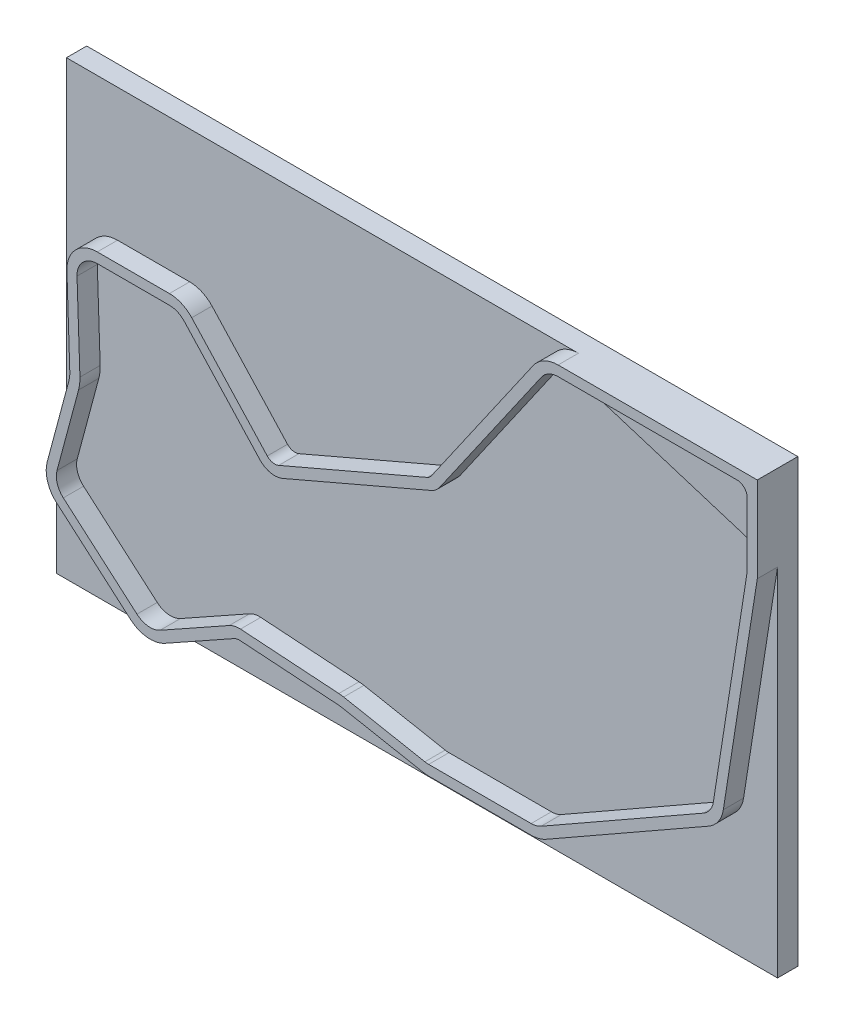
ISO-10303-21;
HEADER;
FILE_DESCRIPTION(('STEP AP214'),'2;1');
FILE_NAME('part.step','',(''),(''),'','','');
FILE_SCHEMA(('AUTOMOTIVE_DESIGN { 1 0 10303 214 1 1 1 1 }'));
ENDSEC;
DATA;
#1=APPLICATION_CONTEXT('core data for automotive mechanical design processes');
#2=APPLICATION_PROTOCOL_DEFINITION('international standard','automotive_design',2000,#1);
#3=PRODUCT_CONTEXT('',#1,'mechanical');
#4=PRODUCT('Part','Part','',(#3));
#5=PRODUCT_RELATED_PRODUCT_CATEGORY('part','',(#4));
#6=PRODUCT_DEFINITION_FORMATION('','',#4);
#7=PRODUCT_DEFINITION_CONTEXT('part definition',#1,'design');
#8=PRODUCT_DEFINITION('design','',#6,#7);
#9=PRODUCT_DEFINITION_SHAPE('','',#8);
#10=(LENGTH_UNIT() NAMED_UNIT(*) SI_UNIT(.MILLI.,.METRE.));
#11=(NAMED_UNIT(*) PLANE_ANGLE_UNIT() SI_UNIT($,.RADIAN.));
#12=(NAMED_UNIT(*) SI_UNIT($,.STERADIAN.) SOLID_ANGLE_UNIT());
#13=UNCERTAINTY_MEASURE_WITH_UNIT(LENGTH_MEASURE(1.E-05),#10,'distance_accuracy_value','');
#14=(GEOMETRIC_REPRESENTATION_CONTEXT(3) GLOBAL_UNCERTAINTY_ASSIGNED_CONTEXT((#13)) GLOBAL_UNIT_ASSIGNED_CONTEXT((#10,
#11,#12)) REPRESENTATION_CONTEXT('',''));
#15=CARTESIAN_POINT('',(0.,0.,0.));
#16=DIRECTION('',(0.,0.,1.));
#17=DIRECTION('',(1.,0.,0.));
#18=AXIS2_PLACEMENT_3D('',#15,#16,#17);
#19=CARTESIAN_POINT('',(324.376369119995,-63.0698522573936,-12.7));
#20=DIRECTION('',(0.,0.,-1.));
#21=DIRECTION('',(-1.,0.,0.));
#22=AXIS2_PLACEMENT_3D('',#19,#20,#21);
#23=PLANE('',#22);
#24=DIRECTION('',(0.954406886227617,-0.298508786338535,0.));
#25=VECTOR('',#24,1.);
#26=CARTESIAN_POINT('',(203.312806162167,206.7083050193,-12.7));
#27=LINE('',#26,#25);
#28=CARTESIAN_POINT('',(203.312806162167,206.7083050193,-12.7));
#29=VERTEX_POINT('',#28);
#30=CARTESIAN_POINT('',(309.117430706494,173.615909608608,-12.7));
#31=VERTEX_POINT('',#30);
#32=EDGE_CURVE('E471',#29,#31,#27,.T.);
#33=ORIENTED_EDGE('',*,*,#32,.F.);
#34=CARTESIAN_POINT('',(199.521744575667,194.587337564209,-12.7));
#35=DIRECTION('',(0.,0.,1.));
#36=DIRECTION('',(1.,0.,0.));
#37=AXIS2_PLACEMENT_3D('',#34,#35,#36);
#38=CIRCLE('',#37,12.7);
#39=CARTESIAN_POINT('',(189.094901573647,201.837919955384,-12.7));
#40=VERTEX_POINT('',#39);
#41=EDGE_CURVE('E454',#29,#40,#38,.T.);
#42=ORIENTED_EDGE('',*,*,#41,.T.);
#43=DIRECTION('',(-0.570911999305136,-0.821011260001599,0.));
#44=VECTOR('',#43,1.);
#45=CARTESIAN_POINT('',(189.094901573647,201.837919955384,-12.7));
#46=LINE('',#45,#44);
#47=CARTESIAN_POINT('',(125.313633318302,110.116009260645,-12.7));
#48=VERTEX_POINT('',#47);
#49=EDGE_CURVE('E521',#40,#48,#46,.T.);
#50=ORIENTED_EDGE('',*,*,#49,.T.);
#51=CARTESIAN_POINT('',(114.886790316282,117.36659165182,-12.7));
#52=DIRECTION('',(0.,0.,-1.));
#53=DIRECTION('',(1.,0.,0.));
#54=AXIS2_PLACEMENT_3D('',#51,#52,#53);
#55=CIRCLE('',#54,12.7);
#56=CARTESIAN_POINT('',(119.901868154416,105.698730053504,-12.7));
#57=VERTEX_POINT('',#56);
#58=EDGE_CURVE('E525',#48,#57,#55,.T.);
#59=ORIENTED_EDGE('',*,*,#58,.T.);
#60=DIRECTION('',(-0.918729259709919,-0.394888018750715,0.));
#61=VECTOR('',#60,1.);
#62=CARTESIAN_POINT('',(119.901868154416,105.698730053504,-12.7));
#63=LINE('',#62,#61);
#64=CARTESIAN_POINT('',(26.9077808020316,65.7280308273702,-12.7));
#65=VERTEX_POINT('',#64);
#66=EDGE_CURVE('E528',#57,#65,#63,.T.);
#67=ORIENTED_EDGE('',*,*,#66,.T.);
#68=CARTESIAN_POINT('',(21.8927029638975,77.3958924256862,-12.7));
#69=DIRECTION('',(0.,0.,-1.));
#70=DIRECTION('',(1.,0.,0.));
#71=AXIS2_PLACEMENT_3D('',#68,#69,#70);
#72=CIRCLE('',#71,12.7);
#73=CARTESIAN_POINT('',(12.5547402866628,68.7881951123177,-12.7));
#74=VERTEX_POINT('',#73);
#75=EDGE_CURVE('E531',#65,#74,#72,.T.);
#76=ORIENTED_EDGE('',*,*,#75,.T.);
#77=DIRECTION('',(-0.67777144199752,0.735272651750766,0.));
#78=VECTOR('',#77,1.);
#79=CARTESIAN_POINT('',(12.5547402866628,68.7881951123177,-12.7));
#80=LINE('',#79,#78);
#81=CARTESIAN_POINT('',(-34.7787272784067,120.137369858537,-12.7));
#82=VERTEX_POINT('',#81);
#83=EDGE_CURVE('E534',#74,#82,#80,.T.);
#84=ORIENTED_EDGE('',*,*,#83,.T.);
#85=CARTESIAN_POINT('',(-44.1166899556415,111.529672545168,-12.7));
#86=DIRECTION('',(0.,0.,1.));
#87=DIRECTION('',(1.,0.,0.));
#88=AXIS2_PLACEMENT_3D('',#85,#86,#87);
#89=CIRCLE('',#88,12.7);
#90=CARTESIAN_POINT('',(-44.1166899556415,124.229672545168,-12.7));
#91=VERTEX_POINT('',#90);
#92=EDGE_CURVE('E537',#82,#91,#89,.T.);
#93=ORIENTED_EDGE('',*,*,#92,.T.);
#94=DIRECTION('',(-1.,0.,0.));
#95=VECTOR('',#94,1.);
#96=CARTESIAN_POINT('',(-44.1166899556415,124.229672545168,-12.7));
#97=LINE('',#96,#95);
#98=CARTESIAN_POINT('',(-89.3213550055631,124.229672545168,-12.7));
#99=VERTEX_POINT('',#98);
#100=EDGE_CURVE('E540',#91,#99,#97,.T.);
#101=ORIENTED_EDGE('',*,*,#100,.T.);
#102=CARTESIAN_POINT('',(-89.3213550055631,111.529672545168,-12.7));
#103=DIRECTION('',(0.,0.,1.));
#104=DIRECTION('',(1.,0.,0.));
#105=AXIS2_PLACEMENT_3D('',#102,#103,#104);
#106=CIRCLE('',#105,12.7);
#107=CARTESIAN_POINT('',(-102.014194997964,111.103277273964,-12.7));
#108=VERTEX_POINT('',#107);
#109=EDGE_CURVE('E543',#99,#108,#106,.T.);
#110=ORIENTED_EDGE('',*,*,#109,.T.);
#111=DIRECTION('',(0.0335744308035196,-0.999436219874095,0.));
#112=VECTOR('',#111,1.);
#113=CARTESIAN_POINT('',(-102.014194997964,111.103277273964,-12.7));
#114=LINE('',#113,#112);
#115=CARTESIAN_POINT('',(-100.202271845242,57.1663501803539,-12.7));
#116=VERTEX_POINT('',#115);
#117=EDGE_CURVE('E546',#108,#116,#114,.T.);
#118=ORIENTED_EDGE('',*,*,#117,.T.);
#119=CARTESIAN_POINT('',(-125.587951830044,56.3135596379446,-12.7));
#120=DIRECTION('',(0.,0.,-1.));
#121=DIRECTION('',(1.,0.,0.));
#122=AXIS2_PLACEMENT_3D('',#119,#120,#121);
#123=CIRCLE('',#122,25.4);
#124=CARTESIAN_POINT('',(-101.052297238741,49.7438066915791,-12.7));
#125=VERTEX_POINT('',#124);
#126=EDGE_CURVE('E549',#116,#125,#123,.T.);
#127=ORIENTED_EDGE('',*,*,#126,.T.);
#128=DIRECTION('',(-0.258651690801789,-0.965970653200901,0.));
#129=VECTOR('',#128,1.);
#130=CARTESIAN_POINT('',(-101.052297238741,49.7438066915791,-12.7));
#131=LINE('',#130,#129);
#132=CARTESIAN_POINT('',(-114.563286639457,-0.714859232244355,-12.7));
#133=VERTEX_POINT('',#132);
#134=EDGE_CURVE('E552',#125,#133,#131,.T.);
#135=ORIENTED_EDGE('',*,*,#134,.T.);
#136=CARTESIAN_POINT('',(-102.295459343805,-3.99973570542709,-12.7));
#137=DIRECTION('',(0.,0.,1.));
#138=DIRECTION('',(1.,0.,0.));
#139=AXIS2_PLACEMENT_3D('',#136,#137,#138);
#140=CIRCLE('',#139,12.7);
#141=CARTESIAN_POINT('',(-110.613924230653,-13.5962528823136,-12.7));
#142=VERTEX_POINT('',#141);
#143=EDGE_CURVE('E555',#133,#142,#140,.T.);
#144=ORIENTED_EDGE('',*,*,#143,.T.);
#145=DIRECTION('',(0.755631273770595,-0.654997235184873,0.));
#146=VECTOR('',#145,1.);
#147=CARTESIAN_POINT('',(-110.613924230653,-13.5962528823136,-12.7));
#148=LINE('',#147,#146);
#149=CARTESIAN_POINT('',(-64.4451008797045,-53.6163694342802,-12.7));
#150=VERTEX_POINT('',#149);
#151=EDGE_CURVE('E558',#142,#150,#148,.T.);
#152=ORIENTED_EDGE('',*,*,#151,.T.);
#153=CARTESIAN_POINT('',(-56.1266359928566,-44.0198522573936,-12.7));
#154=DIRECTION('',(0.,0.,1.));
#155=DIRECTION('',(1.,0.,0.));
#156=AXIS2_PLACEMENT_3D('',#153,#154,#155);
#157=CIRCLE('',#156,12.7);
#158=CARTESIAN_POINT('',(-49.9250783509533,-55.1027527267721,-12.7));
#159=VERTEX_POINT('',#158);
#160=EDGE_CURVE('E561',#150,#159,#157,.T.);
#161=ORIENTED_EDGE('',*,*,#160,.T.);
#162=DIRECTION('',(0.872669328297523,0.488311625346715,0.));
#163=VECTOR('',#162,1.);
#164=CARTESIAN_POINT('',(-49.9250783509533,-55.1027527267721,-12.7));
#165=LINE('',#164,#163);
#166=CARTESIAN_POINT('',(-6.6103816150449,-30.8655425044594,-12.7));
#167=VERTEX_POINT('',#166);
#168=EDGE_CURVE('E564',#159,#167,#165,.T.);
#169=ORIENTED_EDGE('',*,*,#168,.T.);
#170=CARTESIAN_POINT('',(-0.408823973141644,-41.948442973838,-12.7));
#171=DIRECTION('',(0.,0.,-1.));
#172=DIRECTION('',(1.,0.,0.));
#173=AXIS2_PLACEMENT_3D('',#170,#171,#172);
#174=CIRCLE('',#173,12.7);
#175=CARTESIAN_POINT('',(0.445832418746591,-29.277232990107,-12.7));
#176=VERTEX_POINT('',#175);
#177=EDGE_CURVE('E567',#167,#176,#174,.T.);
#178=ORIENTED_EDGE('',*,*,#177,.T.);
#179=DIRECTION('',(0.99773306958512,-0.067295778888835,0.));
#180=VECTOR('',#179,1.);
#181=CARTESIAN_POINT('',(0.445832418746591,-29.277232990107,-12.7));
#182=LINE('',#181,#180);
#183=CARTESIAN_POINT('',(62.0833760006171,-33.4346039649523,-12.7));
#184=VERTEX_POINT('',#183);
#185=EDGE_CURVE('E570',#176,#184,#182,.T.);
#186=ORIENTED_EDGE('',*,*,#185,.T.);
#187=CARTESIAN_POINT('',(60.3740632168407,-58.7770239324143,-12.7));
#188=DIRECTION('',(0.,0.,-1.));
#189=DIRECTION('',(1.,0.,0.));
#190=AXIS2_PLACEMENT_3D('',#187,#188,#189);
#191=CIRCLE('',#190,25.4);
#192=CARTESIAN_POINT('',(65.1267107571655,-33.825624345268,-12.7));
#193=VERTEX_POINT('',#192);
#194=EDGE_CURVE('E573',#184,#193,#191,.T.);
#195=ORIENTED_EDGE('',*,*,#194,.T.);
#196=DIRECTION('',(0.982338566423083,-0.187112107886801,0.));
#197=VECTOR('',#196,1.);
#198=CARTESIAN_POINT('',(65.1267107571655,-33.825624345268,-12.7));
#199=LINE('',#198,#197);
#200=CARTESIAN_POINT('',(116.026623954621,-43.5208459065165,-12.7));
#201=VERTEX_POINT('',#200);
#202=EDGE_CURVE('E576',#193,#201,#199,.T.);
#203=ORIENTED_EDGE('',*,*,#202,.T.);
#204=CARTESIAN_POINT('',(118.402947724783,-31.0451461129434,-12.7));
#205=DIRECTION('',(0.,0.,1.));
#206=DIRECTION('',(1.,0.,0.));
#207=AXIS2_PLACEMENT_3D('',#204,#205,#206);
#208=CIRCLE('',#207,12.7);
#209=CARTESIAN_POINT('',(118.402947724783,-43.7451461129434,-12.7));
#210=VERTEX_POINT('',#209);
#211=EDGE_CURVE('E579',#201,#210,#208,.T.);
#212=ORIENTED_EDGE('',*,*,#211,.T.);
#213=DIRECTION('',(1.,0.,0.));
#214=VECTOR('',#213,1.);
#215=CARTESIAN_POINT('',(118.402947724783,-43.7451461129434,-12.7));
#216=LINE('',#215,#214);
#217=CARTESIAN_POINT('',(182.605679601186,-43.7451461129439,-12.7));
#218=VERTEX_POINT('',#217);
#219=EDGE_CURVE('E582',#210,#218,#216,.T.);
#220=ORIENTED_EDGE('',*,*,#219,.T.);
#221=CARTESIAN_POINT('',(182.605679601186,-31.0451461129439,-12.7));
#222=DIRECTION('',(0.,0.,1.));
#223=DIRECTION('',(1.,0.,0.));
#224=AXIS2_PLACEMENT_3D('',#221,#222,#223);
#225=CIRCLE('',#224,12.7);
#226=CARTESIAN_POINT('',(188.894612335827,-42.078700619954,-12.7));
#227=VERTEX_POINT('',#226);
#228=EDGE_CURVE('E585',#218,#227,#225,.T.);
#229=ORIENTED_EDGE('',*,*,#228,.T.);
#230=DIRECTION('',(0.868783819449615,0.495191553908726,0.));
#231=VECTOR('',#230,1.);
#232=CARTESIAN_POINT('',(188.894612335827,-42.078700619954,-12.7));
#233=LINE('',#232,#231);
#234=CARTESIAN_POINT('',(290.563995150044,15.8710660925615,-12.7));
#235=VERTEX_POINT('',#234);
#236=EDGE_CURVE('E588',#227,#235,#233,.T.);
#237=ORIENTED_EDGE('',*,*,#236,.T.);
#238=CARTESIAN_POINT('',(284.275062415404,26.9046205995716,-12.7));
#239=DIRECTION('',(0.,0.,1.));
#240=DIRECTION('',(1.,0.,0.));
#241=AXIS2_PLACEMENT_3D('',#238,#239,#240);
#242=CIRCLE('',#241,12.7);
#243=CARTESIAN_POINT('',(296.822508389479,24.9420713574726,-12.7));
#244=VERTEX_POINT('',#243);
#245=EDGE_CURVE('E591',#235,#244,#242,.T.);
#246=ORIENTED_EDGE('',*,*,#245,.T.);
#247=DIRECTION('',(0.154531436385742,0.987987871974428,0.));
#248=VECTOR('',#247,1.);
#249=CARTESIAN_POINT('',(296.822508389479,24.9420713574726,-12.7));
#250=LINE('',#249,#248);
#251=CARTESIAN_POINT('',(317.87381509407,159.532392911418,-12.7));
#252=VERTEX_POINT('',#251);
#253=EDGE_CURVE('E594',#244,#252,#250,.T.);
#254=ORIENTED_EDGE('',*,*,#253,.T.);
#255=CARTESIAN_POINT('',(305.326369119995,161.494942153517,-12.7));
#256=DIRECTION('',(0.,0.,-1.));
#257=DIRECTION('',(-1.,0.,0.));
#258=AXIS2_PLACEMENT_3D('',#255,#256,#257);
#259=CIRCLE('',#258,12.7);
#260=EDGE_CURVE('E931',#252,#31,#259,.F.);
#261=ORIENTED_EDGE('',*,*,#260,.T.);
#262=EDGE_LOOP('',(#33,#42,#50,#59,#67,#76,#84,#93,#101,#110,#118,#127,#135,#144,#152,#161,#169,
#178,#186,#195,#203,#212,#220,#229,#237,#246,#254,#261));
#263=FACE_BOUND('',#262,.T.);
#264=ADVANCED_FACE('F30',(#263),#23,.F.);
#265=CARTESIAN_POINT('',(-56.1266359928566,-44.0198522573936,-12.7));
#266=DIRECTION('',(0.,0.,1.));
#267=DIRECTION('',(1.,0.,0.));
#268=AXIS2_PLACEMENT_3D('',#265,#266,#267);
#269=CYLINDRICAL_SURFACE('',#268,19.05);
#270=CARTESIAN_POINT('',(-56.1266359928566,-44.0198522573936,-6.35));
#271=DIRECTION('',(0.,0.,-1.));
#272=DIRECTION('',(1.,0.,0.));
#273=AXIS2_PLACEMENT_3D('',#270,#271,#272);
#274=CIRCLE('',#273,19.05);
#275=CARTESIAN_POINT('',(-56.1266359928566,-63.0698522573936,-6.35));
#276=VERTEX_POINT('',#275);
#277=CARTESIAN_POINT('',(-68.6043333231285,-58.4146280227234,-6.35));
#278=VERTEX_POINT('',#277);
#279=EDGE_CURVE('E458',#276,#278,#274,.T.);
#280=ORIENTED_EDGE('',*,*,#279,.F.);
#281=DIRECTION('',(0.,0.,-1.));
#282=VECTOR('',#281,1.);
#283=CARTESIAN_POINT('',(-56.1266359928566,-63.0698522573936,-6.35));
#284=LINE('',#283,#282);
#285=CARTESIAN_POINT('',(-56.1266359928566,-63.0698522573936,-12.7));
#286=VERTEX_POINT('',#285);
#287=EDGE_CURVE('E484',#276,#286,#284,.T.);
#288=ORIENTED_EDGE('',*,*,#287,.T.);
#289=CARTESIAN_POINT('',(-56.1266359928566,-44.0198522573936,-12.7));
#290=DIRECTION('',(0.,0.,1.));
#291=DIRECTION('',(1.,0.,0.));
#292=AXIS2_PLACEMENT_3D('',#289,#290,#291);
#293=CIRCLE('',#292,19.05);
#294=CARTESIAN_POINT('',(-46.8242995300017,-60.6442029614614,-12.7));
#295=VERTEX_POINT('',#294);
#296=EDGE_CURVE('E830',#295,#286,#293,.F.);
#297=ORIENTED_EDGE('',*,*,#296,.F.);
#298=DIRECTION('',(0.,0.,1.));
#299=VECTOR('',#298,1.);
#300=CARTESIAN_POINT('',(-46.8242995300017,-60.6442029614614,-12.7));
#301=LINE('',#300,#299);
#302=CARTESIAN_POINT('',(-46.8242995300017,-60.6442029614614,0.));
#303=VERTEX_POINT('',#302);
#304=EDGE_CURVE('E865',#303,#295,#301,.F.);
#305=ORIENTED_EDGE('',*,*,#304,.F.);
#306=CARTESIAN_POINT('',(-56.1266359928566,-44.0198522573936,0.));
#307=DIRECTION('',(0.,0.,1.));
#308=DIRECTION('',(1.,0.,0.));
#309=AXIS2_PLACEMENT_3D('',#306,#307,#308);
#310=CIRCLE('',#309,19.05);
#311=CARTESIAN_POINT('',(-68.6043333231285,-58.4146280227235,0.));
#312=VERTEX_POINT('',#311);
#313=EDGE_CURVE('E809',#312,#303,#310,.T.);
#314=ORIENTED_EDGE('',*,*,#313,.F.);
#315=DIRECTION('',(0.,0.,1.));
#316=VECTOR('',#315,1.);
#317=CARTESIAN_POINT('',(-68.6043333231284,-58.4146280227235,-12.7));
#318=LINE('',#317,#316);
#319=EDGE_CURVE('E860',#278,#312,#318,.T.);
#320=ORIENTED_EDGE('',*,*,#319,.F.);
#321=EDGE_LOOP('',(#280,#288,#297,#305,#314,#320));
#322=FACE_BOUND('',#321,.T.);
#323=ADVANCED_FACE('F949',(#322),#269,.T.);
#324=CARTESIAN_POINT('',(-35.7681487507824,130.579672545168,-12.7));
#325=DIRECTION('',(0.,1.,0.));
#326=DIRECTION('',(0.,0.,1.));
#327=AXIS2_PLACEMENT_3D('',#324,#325,#326);
#328=PLANE('',#327);
#329=DIRECTION('',(-1.,0.,0.));
#330=VECTOR('',#329,1.);
#331=CARTESIAN_POINT('',(-35.7681487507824,130.579672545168,0.));
#332=LINE('',#331,#330);
#333=CARTESIAN_POINT('',(-44.1166899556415,130.579672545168,0.));
#334=VERTEX_POINT('',#333);
#335=CARTESIAN_POINT('',(-89.3213550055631,130.579672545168,0.));
#336=VERTEX_POINT('',#335);
#337=EDGE_CURVE('E679',#334,#336,#332,.T.);
#338=ORIENTED_EDGE('',*,*,#337,.F.);
#339=DIRECTION('',(0.,0.,1.));
#340=VECTOR('',#339,1.);
#341=CARTESIAN_POINT('',(-44.1166899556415,130.579672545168,-12.7));
#342=LINE('',#341,#340);
#343=CARTESIAN_POINT('',(-44.1166899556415,130.579672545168,-12.7));
#344=VERTEX_POINT('',#343);
#345=EDGE_CURVE('E848',#334,#344,#342,.F.);
#346=ORIENTED_EDGE('',*,*,#345,.T.);
#347=DIRECTION('',(-1.,0.,0.));
#348=VECTOR('',#347,1.);
#349=CARTESIAN_POINT('',(-35.7681487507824,130.579672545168,-12.7));
#350=LINE('',#349,#348);
#351=CARTESIAN_POINT('',(-89.3213550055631,130.579672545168,-12.7));
#352=VERTEX_POINT('',#351);
#353=EDGE_CURVE('E729',#344,#352,#350,.T.);
#354=ORIENTED_EDGE('',*,*,#353,.T.);
#355=DIRECTION('',(0.,0.,1.));
#356=VECTOR('',#355,1.);
#357=CARTESIAN_POINT('',(-89.3213550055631,130.579672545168,-12.7));
#358=LINE('',#357,#356);
#359=EDGE_CURVE('E845',#352,#336,#358,.T.);
#360=ORIENTED_EDGE('',*,*,#359,.T.);
#361=EDGE_LOOP('',(#338,#346,#354,#360));
#362=FACE_BOUND('',#361,.T.);
#363=ADVANCED_FACE('F957',(#362),#328,.T.);
#364=CARTESIAN_POINT('',(20.2704102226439,69.786878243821,-12.7));
#365=DIRECTION('',(0.735272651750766,0.677771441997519,0.));
#366=DIRECTION('',(-0.67777144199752,0.735272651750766,0.));
#367=AXIS2_PLACEMENT_3D('',#364,#365,#366);
#368=PLANE('',#367);
#369=DIRECTION('',(-0.677771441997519,0.735272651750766,0.));
#370=VECTOR('',#369,1.);
#371=CARTESIAN_POINT('',(20.2704102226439,69.786878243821,0.));
#372=LINE('',#371,#370);
#373=CARTESIAN_POINT('',(17.2237216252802,73.092043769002,0.));
#374=VERTEX_POINT('',#373);
#375=CARTESIAN_POINT('',(-30.1097459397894,124.441218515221,0.));
#376=VERTEX_POINT('',#375);
#377=EDGE_CURVE('E732',#374,#376,#372,.T.);
#378=ORIENTED_EDGE('',*,*,#377,.F.);
#379=DIRECTION('',(0.,0.,1.));
#380=VECTOR('',#379,1.);
#381=CARTESIAN_POINT('',(17.2237216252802,73.092043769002,-12.7));
#382=LINE('',#381,#380);
#383=CARTESIAN_POINT('',(17.2237216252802,73.092043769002,-12.7));
#384=VERTEX_POINT('',#383);
#385=EDGE_CURVE('E910',#374,#384,#382,.F.);
#386=ORIENTED_EDGE('',*,*,#385,.T.);
#387=DIRECTION('',(-0.677771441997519,0.735272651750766,0.));
#388=VECTOR('',#387,1.);
#389=CARTESIAN_POINT('',(20.2704102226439,69.786878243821,-12.7));
#390=LINE('',#389,#388);
#391=CARTESIAN_POINT('',(-30.1097459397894,124.441218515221,-12.7));
#392=VERTEX_POINT('',#391);
#393=EDGE_CURVE('E753',#384,#392,#390,.T.);
#394=ORIENTED_EDGE('',*,*,#393,.T.);
#395=DIRECTION('',(0.,0.,1.));
#396=VECTOR('',#395,1.);
#397=CARTESIAN_POINT('',(-30.1097459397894,124.441218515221,-12.7));
#398=LINE('',#397,#396);
#399=EDGE_CURVE('E842',#392,#376,#398,.T.);
#400=ORIENTED_EDGE('',*,*,#399,.T.);
#401=EDGE_LOOP('',(#378,#386,#394,#400));
#402=FACE_BOUND('',#401,.T.);
#403=ADVANCED_FACE('F1019',(#402),#368,.T.);
#404=CARTESIAN_POINT('',(119.063169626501,112.249961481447,-12.7));
#405=DIRECTION('',(-0.394888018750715,0.918729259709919,0.));
#406=DIRECTION('',(-0.918729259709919,-0.394888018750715,0.));
#407=AXIS2_PLACEMENT_3D('',#404,#405,#406);
#408=PLANE('',#407);
#409=DIRECTION('',(-0.918729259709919,-0.394888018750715,0.));
#410=VECTOR('',#409,1.);
#411=CARTESIAN_POINT('',(119.063169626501,112.249961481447,0.));
#412=LINE('',#411,#410);
#413=CARTESIAN_POINT('',(117.394329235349,111.532660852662,0.));
#414=VERTEX_POINT('',#413);
#415=CARTESIAN_POINT('',(24.4002418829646,71.5619616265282,0.));
#416=VERTEX_POINT('',#415);
#417=EDGE_CURVE('E792',#414,#416,#412,.T.);
#418=ORIENTED_EDGE('',*,*,#417,.F.);
#419=DIRECTION('',(0.,0.,1.));
#420=VECTOR('',#419,1.);
#421=CARTESIAN_POINT('',(117.394329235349,111.532660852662,-12.7));
#422=LINE('',#421,#420);
#423=CARTESIAN_POINT('',(117.394329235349,111.532660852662,-12.7));
#424=VERTEX_POINT('',#423);
#425=EDGE_CURVE('E908',#414,#424,#422,.F.);
#426=ORIENTED_EDGE('',*,*,#425,.T.);
#427=DIRECTION('',(-0.918729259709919,-0.394888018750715,0.));
#428=VECTOR('',#427,1.);
#429=CARTESIAN_POINT('',(119.063169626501,112.249961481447,-12.7));
#430=LINE('',#429,#428);
#431=CARTESIAN_POINT('',(24.4002418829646,71.5619616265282,-12.7));
#432=VERTEX_POINT('',#431);
#433=EDGE_CURVE('E750',#424,#432,#430,.T.);
#434=ORIENTED_EDGE('',*,*,#433,.T.);
#435=DIRECTION('',(0.,0.,1.));
#436=VECTOR('',#435,1.);
#437=CARTESIAN_POINT('',(24.4002418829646,71.5619616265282,0.));
#438=LINE('',#437,#436);
#439=EDGE_CURVE('E905',#432,#416,#438,.T.);
#440=ORIENTED_EDGE('',*,*,#439,.T.);
#441=EDGE_LOOP('',(#418,#426,#434,#440));
#442=FACE_BOUND('',#441,.T.);
#443=ADVANCED_FACE('F1028',(#442),#408,.T.);
#444=CARTESIAN_POINT('',(189.565576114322,213.637337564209,-12.7));
#445=DIRECTION('',(-0.821011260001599,0.570911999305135,0.));
#446=DIRECTION('',(-0.570911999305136,-0.821011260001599,0.));
#447=AXIS2_PLACEMENT_3D('',#444,#445,#446);
#448=PLANE('',#447);
#449=DIRECTION('',(-0.570911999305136,-0.821011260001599,0.));
#450=VECTOR('',#449,1.);
#451=CARTESIAN_POINT('',(189.565576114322,213.637337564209,-12.7));
#452=LINE('',#451,#450);
#453=CARTESIAN_POINT('',(183.881480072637,205.463211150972,-12.7));
#454=VERTEX_POINT('',#453);
#455=CARTESIAN_POINT('',(120.100211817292,113.741300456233,-12.7));
#456=VERTEX_POINT('',#455);
#457=EDGE_CURVE('E748',#454,#456,#452,.T.);
#458=ORIENTED_EDGE('',*,*,#457,.T.);
#459=DIRECTION('',(0.,0.,1.));
#460=VECTOR('',#459,1.);
#461=CARTESIAN_POINT('',(120.100211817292,113.741300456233,0.));
#462=LINE('',#461,#460);
#463=CARTESIAN_POINT('',(120.100211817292,113.741300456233,0.));
#464=VERTEX_POINT('',#463);
#465=EDGE_CURVE('E902',#456,#464,#462,.T.);
#466=ORIENTED_EDGE('',*,*,#465,.T.);
#467=DIRECTION('',(-0.570911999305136,-0.821011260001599,0.));
#468=VECTOR('',#467,1.);
#469=CARTESIAN_POINT('',(189.565576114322,213.637337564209,0.));
#470=LINE('',#469,#468);
#471=CARTESIAN_POINT('',(183.881480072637,205.463211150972,0.));
#472=VERTEX_POINT('',#471);
#473=EDGE_CURVE('E789',#472,#464,#470,.T.);
#474=ORIENTED_EDGE('',*,*,#473,.F.);
#475=DIRECTION('',(0.,0.,1.));
#476=VECTOR('',#475,1.);
#477=CARTESIAN_POINT('',(183.881480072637,205.463211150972,-12.7));
#478=LINE('',#477,#476);
#479=EDGE_CURVE('E819',#472,#454,#478,.F.);
#480=ORIENTED_EDGE('',*,*,#479,.T.);
#481=EDGE_LOOP('',(#458,#466,#474,#480));
#482=FACE_BOUND('',#481,.T.);
#483=ADVANCED_FACE('F1037',(#482),#448,.T.);
#484=CARTESIAN_POINT('',(324.376369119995,213.637337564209,-12.7));
#485=DIRECTION('',(0.,1.,0.));
#486=DIRECTION('',(0.,0.,1.));
#487=AXIS2_PLACEMENT_3D('',#484,#485,#486);
#488=PLANE('',#487);
#489=DIRECTION('',(0.,0.,1.));
#490=VECTOR('',#489,1.);
#491=CARTESIAN_POINT('',(324.376369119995,213.637337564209,-12.7));
#492=LINE('',#491,#490);
#493=CARTESIAN_POINT('',(324.376369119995,213.637337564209,-25.4));
#494=VERTEX_POINT('',#493);
#495=CARTESIAN_POINT('',(324.376369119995,213.637337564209,0.));
#496=VERTEX_POINT('',#495);
#497=EDGE_CURVE('E796',#494,#496,#492,.T.);
#498=ORIENTED_EDGE('',*,*,#497,.F.);
#499=DIRECTION('',(1.,0.,0.));
#500=VECTOR('',#499,1.);
#501=CARTESIAN_POINT('',(324.376369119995,213.637337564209,-25.4));
#502=LINE('',#501,#500);
#503=CARTESIAN_POINT('',(-121.345459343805,213.637337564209,-25.4));
#504=VERTEX_POINT('',#503);
#505=EDGE_CURVE('E497',#504,#494,#502,.T.);
#506=ORIENTED_EDGE('',*,*,#505,.F.);
#507=DIRECTION('',(0.,0.,1.));
#508=VECTOR('',#507,1.);
#509=CARTESIAN_POINT('',(-121.345459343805,213.637337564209,-25.4));
#510=LINE('',#509,#508);
#511=CARTESIAN_POINT('',(-121.345459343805,213.637337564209,-12.7));
#512=VERTEX_POINT('',#511);
#513=EDGE_CURVE('E500',#504,#512,#510,.T.);
#514=ORIENTED_EDGE('',*,*,#513,.T.);
#515=DIRECTION('',(1.,0.,0.));
#516=VECTOR('',#515,1.);
#517=CARTESIAN_POINT('',(324.376369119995,213.637337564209,-12.7));
#518=LINE('',#517,#516);
#519=CARTESIAN_POINT('',(199.521744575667,213.637337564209,-12.7));
#520=VERTEX_POINT('',#519);
#521=EDGE_CURVE('E493',#512,#520,#518,.T.);
#522=ORIENTED_EDGE('',*,*,#521,.T.);
#523=DIRECTION('',(0.,0.,1.));
#524=VECTOR('',#523,1.);
#525=CARTESIAN_POINT('',(199.521744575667,213.637337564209,-12.7));
#526=LINE('',#525,#524);
#527=CARTESIAN_POINT('',(199.521744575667,213.637337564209,0.));
#528=VERTEX_POINT('',#527);
#529=EDGE_CURVE('E798',#520,#528,#526,.T.);
#530=ORIENTED_EDGE('',*,*,#529,.T.);
#531=DIRECTION('',(-1.,0.,0.));
#532=VECTOR('',#531,1.);
#533=CARTESIAN_POINT('',(324.376369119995,213.637337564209,0.));
#534=LINE('',#533,#532);
#535=EDGE_CURVE('E786',#496,#528,#534,.T.);
#536=ORIENTED_EDGE('',*,*,#535,.F.);
#537=EDGE_LOOP('',(#498,#506,#514,#522,#530,#536));
#538=FACE_BOUND('',#537,.T.);
#539=ADVANCED_FACE('F1044',(#538),#488,.T.);
#540=CARTESIAN_POINT('',(324.376369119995,213.637337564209,-12.7));
#541=DIRECTION('',(1.,0.,0.));
#542=DIRECTION('',(0.,0.,-1.));
#543=AXIS2_PLACEMENT_3D('',#540,#541,#542);
#544=PLANE('',#543);
#545=DIRECTION('',(0.,1.,0.));
#546=VECTOR('',#545,1.);
#547=CARTESIAN_POINT('',(324.376369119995,213.637337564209,0.));
#548=LINE('',#547,#546);
#549=CARTESIAN_POINT('',(324.376369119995,160.014136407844,0.));
#550=VERTEX_POINT('',#549);
#551=EDGE_CURVE('E783',#550,#496,#548,.T.);
#552=ORIENTED_EDGE('',*,*,#551,.F.);
#553=DIRECTION('',(0.,0.,1.));
#554=VECTOR('',#553,1.);
#555=CARTESIAN_POINT('',(324.376369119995,160.014136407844,-12.7));
#556=LINE('',#555,#554);
#557=CARTESIAN_POINT('',(324.376369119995,160.014136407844,-12.7));
#558=VERTEX_POINT('',#557);
#559=EDGE_CURVE('E755',#558,#550,#556,.T.);
#560=ORIENTED_EDGE('',*,*,#559,.F.);
#561=DIRECTION('',(0.,-1.,0.));
#562=VECTOR('',#561,1.);
#563=CARTESIAN_POINT('',(324.376369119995,213.637337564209,-12.7));
#564=LINE('',#563,#562);
#565=CARTESIAN_POINT('',(324.376369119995,-63.0698522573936,-12.7));
#566=VERTEX_POINT('',#565);
#567=EDGE_CURVE('E488',#558,#566,#564,.T.);
#568=ORIENTED_EDGE('',*,*,#567,.T.);
#569=DIRECTION('',(0.,0.,1.));
#570=VECTOR('',#569,1.);
#571=CARTESIAN_POINT('',(324.376369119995,-63.0698522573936,-25.4));
#572=LINE('',#571,#570);
#573=CARTESIAN_POINT('',(324.376369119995,-63.0698522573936,-25.4));
#574=VERTEX_POINT('',#573);
#575=EDGE_CURVE('E513',#574,#566,#572,.T.);
#576=ORIENTED_EDGE('',*,*,#575,.F.);
#577=DIRECTION('',(0.,-1.,0.));
#578=VECTOR('',#577,1.);
#579=CARTESIAN_POINT('',(324.376369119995,213.637337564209,-25.4));
#580=LINE('',#579,#578);
#581=EDGE_CURVE('E489',#494,#574,#580,.T.);
#582=ORIENTED_EDGE('',*,*,#581,.F.);
#583=ORIENTED_EDGE('',*,*,#497,.T.);
#584=EDGE_LOOP('',(#552,#560,#568,#576,#582,#583));
#585=FACE_BOUND('',#584,.T.);
#586=ADVANCED_FACE('F1049',(#585),#544,.T.);
#587=CARTESIAN_POINT('',(324.376369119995,160.014136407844,-12.7));
#588=DIRECTION('',(0.987987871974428,-0.154531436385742,0.));
#589=DIRECTION('',(0.154531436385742,0.987987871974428,0.));
#590=AXIS2_PLACEMENT_3D('',#587,#588,#589);
#591=PLANE('',#590);
#592=DIRECTION('',(0.154531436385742,0.987987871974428,0.));
#593=VECTOR('',#592,1.);
#594=CARTESIAN_POINT('',(324.376369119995,160.014136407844,0.));
#595=LINE('',#594,#593);
#596=CARTESIAN_POINT('',(303.096231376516,23.9607967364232,0.));
#597=VERTEX_POINT('',#596);
#598=EDGE_CURVE('E781',#597,#550,#595,.T.);
#599=ORIENTED_EDGE('',*,*,#598,.F.);
#600=DIRECTION('',(0.,0.,1.));
#601=VECTOR('',#600,1.);
#602=CARTESIAN_POINT('',(303.096231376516,23.9607967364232,-12.7));
#603=LINE('',#602,#601);
#604=CARTESIAN_POINT('',(303.096231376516,23.9607967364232,-12.7));
#605=VERTEX_POINT('',#604);
#606=EDGE_CURVE('E885',#597,#605,#603,.F.);
#607=ORIENTED_EDGE('',*,*,#606,.T.);
#608=DIRECTION('',(0.154531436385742,0.987987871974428,0.));
#609=VECTOR('',#608,1.);
#610=CARTESIAN_POINT('',(324.376369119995,160.014136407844,-12.7));
#611=LINE('',#610,#609);
#612=EDGE_CURVE('E746',#605,#558,#611,.T.);
#613=ORIENTED_EDGE('',*,*,#612,.T.);
#614=ORIENTED_EDGE('',*,*,#559,.T.);
#615=EDGE_LOOP('',(#599,#607,#613,#614));
#616=FACE_BOUND('',#615,.T.);
#617=ADVANCED_FACE('F1119',(#616),#591,.T.);
#618=CARTESIAN_POINT('',(301.67857874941,14.8971160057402,-12.7));
#619=DIRECTION('',(0.495191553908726,-0.868783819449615,0.));
#620=DIRECTION('',(0.868783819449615,0.495191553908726,0.));
#621=AXIS2_PLACEMENT_3D('',#618,#619,#620);
#622=PLANE('',#621);
#623=DIRECTION('',(0.868783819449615,0.495191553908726,0.));
#624=VECTOR('',#623,1.);
#625=CARTESIAN_POINT('',(301.67857874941,14.8971160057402,0.));
#626=LINE('',#625,#624);
#627=CARTESIAN_POINT('',(192.039078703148,-47.5954778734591,0.));
#628=VERTEX_POINT('',#627);
#629=CARTESIAN_POINT('',(293.708461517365,10.3542888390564,0.));
#630=VERTEX_POINT('',#629);
#631=EDGE_CURVE('E778',#628,#630,#626,.T.);
#632=ORIENTED_EDGE('',*,*,#631,.F.);
#633=DIRECTION('',(0.,0.,1.));
#634=VECTOR('',#633,1.);
#635=CARTESIAN_POINT('',(192.039078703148,-47.5954778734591,-12.7));
#636=LINE('',#635,#634);
#637=CARTESIAN_POINT('',(192.039078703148,-47.5954778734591,-12.7));
#638=VERTEX_POINT('',#637);
#639=EDGE_CURVE('E883',#628,#638,#636,.F.);
#640=ORIENTED_EDGE('',*,*,#639,.T.);
#641=DIRECTION('',(0.868783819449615,0.495191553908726,0.));
#642=VECTOR('',#641,1.);
#643=CARTESIAN_POINT('',(301.67857874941,14.8971160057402,-12.7));
#644=LINE('',#643,#642);
#645=CARTESIAN_POINT('',(293.708461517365,10.3542888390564,-12.7));
#646=VERTEX_POINT('',#645);
#647=EDGE_CURVE('E744',#638,#646,#644,.T.);
#648=ORIENTED_EDGE('',*,*,#647,.T.);
#649=DIRECTION('',(0.,0.,1.));
#650=VECTOR('',#649,1.);
#651=CARTESIAN_POINT('',(293.708461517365,10.3542888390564,-12.7));
#652=LINE('',#651,#650);
#653=EDGE_CURVE('E880',#646,#630,#652,.T.);
#654=ORIENTED_EDGE('',*,*,#653,.T.);
#655=EDGE_LOOP('',(#632,#640,#648,#654));
#656=FACE_BOUND('',#655,.T.);
#657=ADVANCED_FACE('F1114',(#656),#622,.T.);
#658=CARTESIAN_POINT('',(187.653561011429,-50.095146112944,-12.7));
#659=DIRECTION('',(0.,-1.,0.));
#660=DIRECTION('',(1.,0.,0.));
#661=AXIS2_PLACEMENT_3D('',#658,#659,#660);
#662=PLANE('',#661);
#663=DIRECTION('',(1.,0.,0.));
#664=VECTOR('',#663,1.);
#665=CARTESIAN_POINT('',(187.653561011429,-50.095146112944,0.));
#666=LINE('',#665,#664);
#667=CARTESIAN_POINT('',(118.402947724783,-50.0951461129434,0.));
#668=VERTEX_POINT('',#667);
#669=CARTESIAN_POINT('',(182.605679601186,-50.0951461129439,0.));
#670=VERTEX_POINT('',#669);
#671=EDGE_CURVE('E775',#668,#670,#666,.T.);
#672=ORIENTED_EDGE('',*,*,#671,.F.);
#673=DIRECTION('',(0.,0.,1.));
#674=VECTOR('',#673,1.);
#675=CARTESIAN_POINT('',(118.402947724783,-50.0951461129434,-12.7));
#676=LINE('',#675,#674);
#677=CARTESIAN_POINT('',(118.402947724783,-50.0951461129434,-12.7));
#678=VERTEX_POINT('',#677);
#679=EDGE_CURVE('E878',#668,#678,#676,.F.);
#680=ORIENTED_EDGE('',*,*,#679,.T.);
#681=DIRECTION('',(1.,0.,0.));
#682=VECTOR('',#681,1.);
#683=CARTESIAN_POINT('',(187.653561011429,-50.095146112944,-12.7));
#684=LINE('',#683,#682);
#685=CARTESIAN_POINT('',(182.605679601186,-50.0951461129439,-12.7));
#686=VERTEX_POINT('',#685);
#687=EDGE_CURVE('E742',#678,#686,#684,.T.);
#688=ORIENTED_EDGE('',*,*,#687,.T.);
#689=DIRECTION('',(0.,0.,1.));
#690=VECTOR('',#689,1.);
#691=CARTESIAN_POINT('',(182.605679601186,-50.0951461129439,-12.7));
#692=LINE('',#691,#690);
#693=EDGE_CURVE('E875',#686,#670,#692,.T.);
#694=ORIENTED_EDGE('',*,*,#693,.T.);
#695=EDGE_LOOP('',(#672,#680,#688,#694));
#696=FACE_BOUND('',#695,.T.);
#697=ADVANCED_FACE('F1103',(#696),#662,.T.);
#698=CARTESIAN_POINT('',(116.604826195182,-50.0951461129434,-12.7));
#699=DIRECTION('',(-0.187112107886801,-0.982338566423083,0.));
#700=DIRECTION('',(0.982338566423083,-0.187112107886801,0.));
#701=AXIS2_PLACEMENT_3D('',#698,#699,#700);
#702=PLANE('',#701);
#703=DIRECTION('',(0.982338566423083,-0.187112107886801,0.));
#704=VECTOR('',#703,1.);
#705=CARTESIAN_POINT('',(116.604826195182,-50.0951461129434,0.));
#706=LINE('',#705,#704);
#707=CARTESIAN_POINT('',(63.9385488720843,-40.0634742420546,0.));
#708=VERTEX_POINT('',#707);
#709=CARTESIAN_POINT('',(114.838462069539,-49.7586958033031,0.));
#710=VERTEX_POINT('',#709);
#711=EDGE_CURVE('E772',#708,#710,#706,.T.);
#712=ORIENTED_EDGE('',*,*,#711,.F.);
#713=DIRECTION('',(0.,0.,1.));
#714=VECTOR('',#713,1.);
#715=CARTESIAN_POINT('',(63.9385488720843,-40.0634742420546,-12.7));
#716=LINE('',#715,#714);
#717=CARTESIAN_POINT('',(63.9385488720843,-40.0634742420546,-12.7));
#718=VERTEX_POINT('',#717);
#719=EDGE_CURVE('E873',#708,#718,#716,.F.);
#720=ORIENTED_EDGE('',*,*,#719,.T.);
#721=DIRECTION('',(0.982338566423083,-0.187112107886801,0.));
#722=VECTOR('',#721,1.);
#723=CARTESIAN_POINT('',(116.604826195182,-50.0951461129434,-12.7));
#724=LINE('',#723,#722);
#725=CARTESIAN_POINT('',(114.838462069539,-49.7586958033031,-12.7));
#726=VERTEX_POINT('',#725);
#727=EDGE_CURVE('E740',#718,#726,#724,.T.);
#728=ORIENTED_EDGE('',*,*,#727,.T.);
#729=DIRECTION('',(0.,0.,1.));
#730=VECTOR('',#729,1.);
#731=CARTESIAN_POINT('',(114.838462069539,-49.7586958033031,-12.7));
#732=LINE('',#731,#730);
#733=EDGE_CURVE('E870',#726,#710,#732,.T.);
#734=ORIENTED_EDGE('',*,*,#733,.T.);
#735=EDGE_LOOP('',(#712,#720,#728,#734));
#736=FACE_BOUND('',#735,.T.);
#737=ADVANCED_FACE('F1097',(#736),#702,.T.);
#738=CARTESIAN_POINT('',(62.8061712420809,-39.8477832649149,-12.7));
#739=DIRECTION('',(-0.067295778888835,-0.99773306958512,0.));
#740=DIRECTION('',(0.99773306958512,-0.067295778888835,0.));
#741=AXIS2_PLACEMENT_3D('',#738,#739,#740);
#742=PLANE('',#741);
#743=DIRECTION('',(0.997733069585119,-0.067295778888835,0.));
#744=VECTOR('',#743,1.);
#745=CARTESIAN_POINT('',(62.8061712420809,-39.8477832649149,0.));
#746=LINE('',#745,#744);
#747=CARTESIAN_POINT('',(0.0185042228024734,-35.6128379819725,0.));
#748=VERTEX_POINT('',#747);
#749=CARTESIAN_POINT('',(61.656047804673,-39.7702089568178,0.));
#750=VERTEX_POINT('',#749);
#751=EDGE_CURVE('E770',#748,#750,#746,.T.);
#752=ORIENTED_EDGE('',*,*,#751,.F.);
#753=DIRECTION('',(0.,0.,1.));
#754=VECTOR('',#753,1.);
#755=CARTESIAN_POINT('',(0.0185042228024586,-35.6128379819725,-12.7));
#756=LINE('',#755,#754);
#757=CARTESIAN_POINT('',(0.0185042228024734,-35.6128379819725,-12.7));
#758=VERTEX_POINT('',#757);
#759=EDGE_CURVE('E900',#748,#758,#756,.F.);
#760=ORIENTED_EDGE('',*,*,#759,.T.);
#761=DIRECTION('',(0.997733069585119,-0.067295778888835,0.));
#762=VECTOR('',#761,1.);
#763=CARTESIAN_POINT('',(62.8061712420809,-39.8477832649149,-12.7));
#764=LINE('',#763,#762);
#765=CARTESIAN_POINT('',(61.656047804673,-39.7702089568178,-12.7));
#766=VERTEX_POINT('',#765);
#767=EDGE_CURVE('E738',#758,#766,#764,.T.);
#768=ORIENTED_EDGE('',*,*,#767,.T.);
#769=DIRECTION('',(0.,0.,1.));
#770=VECTOR('',#769,1.);
#771=CARTESIAN_POINT('',(61.656047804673,-39.7702089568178,0.));
#772=LINE('',#771,#770);
#773=EDGE_CURVE('E867',#766,#750,#772,.T.);
#774=ORIENTED_EDGE('',*,*,#773,.T.);
#775=EDGE_LOOP('',(#752,#760,#768,#774));
#776=FACE_BOUND('',#775,.T.);
#777=ADVANCED_FACE('F1085',(#776),#742,.T.);
#778=CARTESIAN_POINT('',(-1.86350204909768,-35.4858991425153,-12.7));
#779=DIRECTION('',(0.488311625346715,-0.872669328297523,0.));
#780=DIRECTION('',(0.872669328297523,0.488311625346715,0.));
#781=AXIS2_PLACEMENT_3D('',#778,#779,#780);
#782=PLANE('',#781);
#783=DIRECTION('',(0.872669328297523,0.488311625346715,0.));
#784=VECTOR('',#783,1.);
#785=CARTESIAN_POINT('',(-1.86350204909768,-35.4858991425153,-12.7));
#786=LINE('',#785,#784);
#787=CARTESIAN_POINT('',(-3.50960279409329,-36.4069927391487,-12.7));
#788=VERTEX_POINT('',#787);
#789=EDGE_CURVE('E736',#295,#788,#786,.T.);
#790=ORIENTED_EDGE('',*,*,#789,.T.);
#791=DIRECTION('',(0.,0.,1.));
#792=VECTOR('',#791,1.);
#793=CARTESIAN_POINT('',(-3.50960279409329,-36.4069927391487,0.));
#794=LINE('',#793,#792);
#795=CARTESIAN_POINT('',(-3.50960279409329,-36.4069927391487,0.));
#796=VERTEX_POINT('',#795);
#797=EDGE_CURVE('E897',#788,#796,#794,.T.);
#798=ORIENTED_EDGE('',*,*,#797,.T.);
#799=DIRECTION('',(0.872669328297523,0.488311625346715,0.));
#800=VECTOR('',#799,1.);
#801=CARTESIAN_POINT('',(-1.86350204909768,-35.4858991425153,0.));
#802=LINE('',#801,#800);
#803=EDGE_CURVE('E767',#303,#796,#802,.T.);
#804=ORIENTED_EDGE('',*,*,#803,.F.);
#805=ORIENTED_EDGE('',*,*,#304,.T.);
#806=EDGE_LOOP('',(#790,#798,#804,#805));
#807=FACE_BOUND('',#806,.T.);
#808=ADVANCED_FACE('F1073',(#807),#782,.T.);
#809=CARTESIAN_POINT('',(-123.78035289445,-10.5868825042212,-12.7));
#810=DIRECTION('',(-0.654997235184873,-0.755631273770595,0.));
#811=DIRECTION('',(0.755631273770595,-0.654997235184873,0.));
#812=AXIS2_PLACEMENT_3D('',#809,#810,#811);
#813=PLANE('',#812);
#814=DIRECTION('',(-0.755631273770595,0.654997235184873,0.));
#815=VECTOR('',#814,1.);
#816=CARTESIAN_POINT('',(-68.6043333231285,-58.4146280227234,-6.35));
#817=LINE('',#816,#815);
#818=CARTESIAN_POINT('',(-114.773156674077,-18.3945114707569,-6.35));
#819=VERTEX_POINT('',#818);
#820=EDGE_CURVE('E475',#278,#819,#817,.T.);
#821=ORIENTED_EDGE('',*,*,#820,.F.);
#822=ORIENTED_EDGE('',*,*,#319,.T.);
#823=DIRECTION('',(0.755631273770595,-0.654997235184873,0.));
#824=VECTOR('',#823,1.);
#825=CARTESIAN_POINT('',(-123.78035289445,-10.5868825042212,0.));
#826=LINE('',#825,#824);
#827=CARTESIAN_POINT('',(-114.773156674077,-18.3945114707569,0.));
#828=VERTEX_POINT('',#827);
#829=EDGE_CURVE('E764',#828,#312,#826,.T.);
#830=ORIENTED_EDGE('',*,*,#829,.F.);
#831=DIRECTION('',(0.,0.,1.));
#832=VECTOR('',#831,1.);
#833=CARTESIAN_POINT('',(-114.773156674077,-18.3945114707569,-12.7));
#834=LINE('',#833,#832);
#835=EDGE_CURVE('E862',#828,#819,#834,.F.);
#836=ORIENTED_EDGE('',*,*,#835,.T.);
#837=EDGE_LOOP('',(#821,#822,#830,#836));
#838=FACE_BOUND('',#837,.T.);
#839=ADVANCED_FACE('F1069',(#838),#813,.T.);
#840=CARTESIAN_POINT('',(-106.453594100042,54.1223040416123,-12.7));
#841=DIRECTION('',(-0.965970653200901,0.258651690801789,0.));
#842=DIRECTION('',(-0.258651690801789,-0.965970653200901,0.));
#843=AXIS2_PLACEMENT_3D('',#840,#841,#842);
#844=PLANE('',#843);
#845=DIRECTION('',(-0.258651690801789,-0.965970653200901,0.));
#846=VECTOR('',#845,1.);
#847=CARTESIAN_POINT('',(-106.453594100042,54.1223040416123,-12.7));
#848=LINE('',#847,#846);
#849=CARTESIAN_POINT('',(-107.186210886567,51.3862449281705,-12.7));
#850=VERTEX_POINT('',#849);
#851=CARTESIAN_POINT('',(-120.697200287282,0.927579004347,-12.7));
#852=VERTEX_POINT('',#851);
#853=EDGE_CURVE('E734',#850,#852,#848,.T.);
#854=ORIENTED_EDGE('',*,*,#853,.T.);
#855=DIRECTION('',(0.,0.,1.));
#856=VECTOR('',#855,1.);
#857=CARTESIAN_POINT('',(-120.697200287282,0.927579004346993,-12.7));
#858=LINE('',#857,#856);
#859=CARTESIAN_POINT('',(-120.697200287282,0.927579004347,0.));
#860=VERTEX_POINT('',#859);
#861=EDGE_CURVE('E857',#852,#860,#858,.T.);
#862=ORIENTED_EDGE('',*,*,#861,.T.);
#863=DIRECTION('',(-0.258651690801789,-0.965970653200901,0.));
#864=VECTOR('',#863,1.);
#865=CARTESIAN_POINT('',(-106.453594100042,54.1223040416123,0.));
#866=LINE('',#865,#864);
#867=CARTESIAN_POINT('',(-107.186210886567,51.3862449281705,0.));
#868=VERTEX_POINT('',#867);
#869=EDGE_CURVE('E761',#868,#860,#866,.T.);
#870=ORIENTED_EDGE('',*,*,#869,.F.);
#871=DIRECTION('',(0.,0.,1.));
#872=VECTOR('',#871,1.);
#873=CARTESIAN_POINT('',(-107.186210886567,51.3862449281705,-12.7));
#874=LINE('',#873,#872);
#875=EDGE_CURVE('E855',#868,#850,#874,.F.);
#876=ORIENTED_EDGE('',*,*,#875,.T.);
#877=EDGE_LOOP('',(#854,#862,#870,#876));
#878=FACE_BOUND('',#877,.T.);
#879=ADVANCED_FACE('F990',(#878),#844,.T.);
#880=CARTESIAN_POINT('',(-109.022054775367,130.579672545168,-12.7));
#881=DIRECTION('',(-0.999436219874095,-0.0335744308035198,0.));
#882=DIRECTION('',(0.0335744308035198,-0.999436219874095,0.));
#883=AXIS2_PLACEMENT_3D('',#880,#881,#882);
#884=PLANE('',#883);
#885=DIRECTION('',(0.0335744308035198,-0.999436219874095,0.));
#886=VECTOR('',#885,1.);
#887=CARTESIAN_POINT('',(-109.022054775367,130.579672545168,0.));
#888=LINE('',#887,#886);
#889=CARTESIAN_POINT('',(-108.360614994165,110.890079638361,0.));
#890=VERTEX_POINT('',#889);
#891=CARTESIAN_POINT('',(-106.548691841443,56.9531525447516,0.));
#892=VERTEX_POINT('',#891);
#893=EDGE_CURVE('E758',#890,#892,#888,.T.);
#894=ORIENTED_EDGE('',*,*,#893,.F.);
#895=DIRECTION('',(0.,0.,1.));
#896=VECTOR('',#895,1.);
#897=CARTESIAN_POINT('',(-108.360614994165,110.890079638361,-12.7));
#898=LINE('',#897,#896);
#899=CARTESIAN_POINT('',(-108.360614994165,110.890079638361,-12.7));
#900=VERTEX_POINT('',#899);
#901=EDGE_CURVE('E853',#890,#900,#898,.F.);
#902=ORIENTED_EDGE('',*,*,#901,.T.);
#903=DIRECTION('',(0.0335744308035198,-0.999436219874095,0.));
#904=VECTOR('',#903,1.);
#905=CARTESIAN_POINT('',(-109.022054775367,130.579672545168,-12.7));
#906=LINE('',#905,#904);
#907=CARTESIAN_POINT('',(-106.548691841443,56.9531525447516,-12.7));
#908=VERTEX_POINT('',#907);
#909=EDGE_CURVE('E731',#900,#908,#906,.T.);
#910=ORIENTED_EDGE('',*,*,#909,.T.);
#911=DIRECTION('',(0.,0.,1.));
#912=VECTOR('',#911,1.);
#913=CARTESIAN_POINT('',(-106.548691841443,56.9531525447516,0.));
#914=LINE('',#913,#912);
#915=EDGE_CURVE('E850',#908,#892,#914,.T.);
#916=ORIENTED_EDGE('',*,*,#915,.T.);
#917=EDGE_LOOP('',(#894,#902,#910,#916));
#918=FACE_BOUND('',#917,.T.);
#919=ADVANCED_FACE('F1001',(#918),#884,.T.);
#920=CARTESIAN_POINT('',(324.376369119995,130.579672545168,0.));
#921=DIRECTION('',(0.,0.,1.));
#922=DIRECTION('',(1.,0.,0.));
#923=AXIS2_PLACEMENT_3D('',#920,#921,#922);
#924=PLANE('',#923);
#925=DIRECTION('',(0.,1.,0.));
#926=VECTOR('',#925,1.);
#927=CARTESIAN_POINT('',(318.026369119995,160.507738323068,0.));
#928=LINE('',#927,#926);
#929=CARTESIAN_POINT('',(318.026369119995,161.494942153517,0.));
#930=VERTEX_POINT('',#929);
#931=CARTESIAN_POINT('',(318.026369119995,200.937337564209,0.));
#932=VERTEX_POINT('',#931);
#933=EDGE_CURVE('E519',#930,#932,#928,.T.);
#934=ORIENTED_EDGE('',*,*,#933,.F.);
#935=CARTESIAN_POINT('',(305.326369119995,161.494942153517,0.));
#936=DIRECTION('',(0.,0.,1.));
#937=DIRECTION('',(1.,0.,0.));
#938=AXIS2_PLACEMENT_3D('',#935,#936,#937);
#939=CIRCLE('',#938,12.7);
#940=CARTESIAN_POINT('',(317.87381509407,159.532392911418,0.));
#941=VERTEX_POINT('',#940);
#942=EDGE_CURVE('E933',#930,#941,#939,.F.);
#943=ORIENTED_EDGE('',*,*,#942,.T.);
#944=DIRECTION('',(0.154531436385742,0.987987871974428,0.));
#945=VECTOR('',#944,1.);
#946=CARTESIAN_POINT('',(296.822508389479,24.9420713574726,0.));
#947=LINE('',#946,#945);
#948=CARTESIAN_POINT('',(296.822508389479,24.9420713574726,0.));
#949=VERTEX_POINT('',#948);
#950=EDGE_CURVE('E522',#949,#941,#947,.T.);
#951=ORIENTED_EDGE('',*,*,#950,.F.);
#952=CARTESIAN_POINT('',(284.275062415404,26.9046205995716,0.));
#953=DIRECTION('',(0.,0.,1.));
#954=DIRECTION('',(1.,0.,0.));
#955=AXIS2_PLACEMENT_3D('',#952,#953,#954);
#956=CIRCLE('',#955,12.7);
#957=CARTESIAN_POINT('',(290.563995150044,15.8710660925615,0.));
#958=VERTEX_POINT('',#957);
#959=EDGE_CURVE('E672',#958,#949,#956,.T.);
#960=ORIENTED_EDGE('',*,*,#959,.F.);
#961=DIRECTION('',(0.868783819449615,0.495191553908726,0.));
#962=VECTOR('',#961,1.);
#963=CARTESIAN_POINT('',(188.894612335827,-42.078700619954,0.));
#964=LINE('',#963,#962);
#965=CARTESIAN_POINT('',(188.894612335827,-42.078700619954,0.));
#966=VERTEX_POINT('',#965);
#967=EDGE_CURVE('E669',#966,#958,#964,.T.);
#968=ORIENTED_EDGE('',*,*,#967,.F.);
#969=CARTESIAN_POINT('',(182.605679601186,-31.0451461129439,0.));
#970=DIRECTION('',(0.,0.,1.));
#971=DIRECTION('',(1.,0.,0.));
#972=AXIS2_PLACEMENT_3D('',#969,#970,#971);
#973=CIRCLE('',#972,12.7);
#974=CARTESIAN_POINT('',(182.605679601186,-43.7451461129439,0.));
#975=VERTEX_POINT('',#974);
#976=EDGE_CURVE('E666',#975,#966,#973,.T.);
#977=ORIENTED_EDGE('',*,*,#976,.F.);
#978=DIRECTION('',(1.,0.,0.));
#979=VECTOR('',#978,1.);
#980=CARTESIAN_POINT('',(118.402947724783,-43.7451461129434,0.));
#981=LINE('',#980,#979);
#982=CARTESIAN_POINT('',(118.402947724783,-43.7451461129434,0.));
#983=VERTEX_POINT('',#982);
#984=EDGE_CURVE('E663',#983,#975,#981,.T.);
#985=ORIENTED_EDGE('',*,*,#984,.F.);
#986=CARTESIAN_POINT('',(118.402947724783,-31.0451461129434,0.));
#987=DIRECTION('',(0.,0.,1.));
#988=DIRECTION('',(1.,0.,0.));
#989=AXIS2_PLACEMENT_3D('',#986,#987,#988);
#990=CIRCLE('',#989,12.7);
#991=CARTESIAN_POINT('',(116.026623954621,-43.5208459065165,0.));
#992=VERTEX_POINT('',#991);
#993=EDGE_CURVE('E660',#992,#983,#990,.T.);
#994=ORIENTED_EDGE('',*,*,#993,.F.);
#995=DIRECTION('',(0.982338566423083,-0.187112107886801,0.));
#996=VECTOR('',#995,1.);
#997=CARTESIAN_POINT('',(65.1267107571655,-33.825624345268,0.));
#998=LINE('',#997,#996);
#999=CARTESIAN_POINT('',(65.1267107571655,-33.825624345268,0.));
#1000=VERTEX_POINT('',#999);
#1001=EDGE_CURVE('E657',#1000,#992,#998,.T.);
#1002=ORIENTED_EDGE('',*,*,#1001,.F.);
#1003=CARTESIAN_POINT('',(60.3740632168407,-58.7770239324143,0.));
#1004=DIRECTION('',(0.,0.,-1.));
#1005=DIRECTION('',(1.,0.,0.));
#1006=AXIS2_PLACEMENT_3D('',#1003,#1004,#1005);
#1007=CIRCLE('',#1006,25.4);
#1008=CARTESIAN_POINT('',(62.0833760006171,-33.4346039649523,0.));
#1009=VERTEX_POINT('',#1008);
#1010=EDGE_CURVE('E654',#1009,#1000,#1007,.T.);
#1011=ORIENTED_EDGE('',*,*,#1010,.F.);
#1012=DIRECTION('',(0.99773306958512,-0.067295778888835,0.));
#1013=VECTOR('',#1012,1.);
#1014=CARTESIAN_POINT('',(0.445832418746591,-29.277232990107,0.));
#1015=LINE('',#1014,#1013);
#1016=CARTESIAN_POINT('',(0.445832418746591,-29.277232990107,0.));
#1017=VERTEX_POINT('',#1016);
#1018=EDGE_CURVE('E651',#1017,#1009,#1015,.T.);
#1019=ORIENTED_EDGE('',*,*,#1018,.F.);
#1020=CARTESIAN_POINT('',(-0.408823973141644,-41.948442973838,0.));
#1021=DIRECTION('',(0.,0.,-1.));
#1022=DIRECTION('',(1.,0.,0.));
#1023=AXIS2_PLACEMENT_3D('',#1020,#1021,#1022);
#1024=CIRCLE('',#1023,12.7);
#1025=CARTESIAN_POINT('',(-6.6103816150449,-30.8655425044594,0.));
#1026=VERTEX_POINT('',#1025);
#1027=EDGE_CURVE('E648',#1026,#1017,#1024,.T.);
#1028=ORIENTED_EDGE('',*,*,#1027,.F.);
#1029=DIRECTION('',(0.872669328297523,0.488311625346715,0.));
#1030=VECTOR('',#1029,1.);
#1031=CARTESIAN_POINT('',(-49.9250783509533,-55.1027527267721,0.));
#1032=LINE('',#1031,#1030);
#1033=CARTESIAN_POINT('',(-49.9250783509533,-55.1027527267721,0.));
#1034=VERTEX_POINT('',#1033);
#1035=EDGE_CURVE('E645',#1034,#1026,#1032,.T.);
#1036=ORIENTED_EDGE('',*,*,#1035,.F.);
#1037=CARTESIAN_POINT('',(-56.1266359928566,-44.0198522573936,0.));
#1038=DIRECTION('',(0.,0.,1.));
#1039=DIRECTION('',(1.,0.,0.));
#1040=AXIS2_PLACEMENT_3D('',#1037,#1038,#1039);
#1041=CIRCLE('',#1040,12.7);
#1042=CARTESIAN_POINT('',(-64.4451008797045,-53.6163694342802,0.));
#1043=VERTEX_POINT('',#1042);
#1044=EDGE_CURVE('E642',#1043,#1034,#1041,.T.);
#1045=ORIENTED_EDGE('',*,*,#1044,.F.);
#1046=DIRECTION('',(0.755631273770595,-0.654997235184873,0.));
#1047=VECTOR('',#1046,1.);
#1048=CARTESIAN_POINT('',(-110.613924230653,-13.5962528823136,0.));
#1049=LINE('',#1048,#1047);
#1050=CARTESIAN_POINT('',(-110.613924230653,-13.5962528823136,0.));
#1051=VERTEX_POINT('',#1050);
#1052=EDGE_CURVE('E639',#1051,#1043,#1049,.T.);
#1053=ORIENTED_EDGE('',*,*,#1052,.F.);
#1054=CARTESIAN_POINT('',(-102.295459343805,-3.99973570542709,0.));
#1055=DIRECTION('',(0.,0.,1.));
#1056=DIRECTION('',(1.,0.,0.));
#1057=AXIS2_PLACEMENT_3D('',#1054,#1055,#1056);
#1058=CIRCLE('',#1057,12.7);
#1059=CARTESIAN_POINT('',(-114.563286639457,-0.714859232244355,0.));
#1060=VERTEX_POINT('',#1059);
#1061=EDGE_CURVE('E636',#1060,#1051,#1058,.T.);
#1062=ORIENTED_EDGE('',*,*,#1061,.F.);
#1063=DIRECTION('',(-0.258651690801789,-0.965970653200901,0.));
#1064=VECTOR('',#1063,1.);
#1065=CARTESIAN_POINT('',(-101.052297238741,49.7438066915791,0.));
#1066=LINE('',#1065,#1064);
#1067=CARTESIAN_POINT('',(-101.052297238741,49.7438066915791,0.));
#1068=VERTEX_POINT('',#1067);
#1069=EDGE_CURVE('E633',#1068,#1060,#1066,.T.);
#1070=ORIENTED_EDGE('',*,*,#1069,.F.);
#1071=CARTESIAN_POINT('',(-125.587951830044,56.3135596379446,0.));
#1072=DIRECTION('',(0.,0.,-1.));
#1073=DIRECTION('',(1.,0.,0.));
#1074=AXIS2_PLACEMENT_3D('',#1071,#1072,#1073);
#1075=CIRCLE('',#1074,25.4);
#1076=CARTESIAN_POINT('',(-100.202271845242,57.1663501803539,0.));
#1077=VERTEX_POINT('',#1076);
#1078=EDGE_CURVE('E630',#1077,#1068,#1075,.T.);
#1079=ORIENTED_EDGE('',*,*,#1078,.F.);
#1080=DIRECTION('',(0.0335744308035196,-0.999436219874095,0.));
#1081=VECTOR('',#1080,1.);
#1082=CARTESIAN_POINT('',(-102.014194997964,111.103277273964,0.));
#1083=LINE('',#1082,#1081);
#1084=CARTESIAN_POINT('',(-102.014194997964,111.103277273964,0.));
#1085=VERTEX_POINT('',#1084);
#1086=EDGE_CURVE('E627',#1085,#1077,#1083,.T.);
#1087=ORIENTED_EDGE('',*,*,#1086,.F.);
#1088=CARTESIAN_POINT('',(-89.3213550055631,111.529672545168,0.));
#1089=DIRECTION('',(0.,0.,1.));
#1090=DIRECTION('',(1.,0.,0.));
#1091=AXIS2_PLACEMENT_3D('',#1088,#1089,#1090);
#1092=CIRCLE('',#1091,12.7);
#1093=CARTESIAN_POINT('',(-89.3213550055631,124.229672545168,0.));
#1094=VERTEX_POINT('',#1093);
#1095=EDGE_CURVE('E624',#1094,#1085,#1092,.T.);
#1096=ORIENTED_EDGE('',*,*,#1095,.F.);
#1097=DIRECTION('',(-1.,0.,0.));
#1098=VECTOR('',#1097,1.);
#1099=CARTESIAN_POINT('',(-44.1166899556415,124.229672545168,0.));
#1100=LINE('',#1099,#1098);
#1101=CARTESIAN_POINT('',(-44.1166899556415,124.229672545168,0.));
#1102=VERTEX_POINT('',#1101);
#1103=EDGE_CURVE('E621',#1102,#1094,#1100,.T.);
#1104=ORIENTED_EDGE('',*,*,#1103,.F.);
#1105=CARTESIAN_POINT('',(-44.1166899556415,111.529672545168,0.));
#1106=DIRECTION('',(0.,0.,1.));
#1107=DIRECTION('',(1.,0.,0.));
#1108=AXIS2_PLACEMENT_3D('',#1105,#1106,#1107);
#1109=CIRCLE('',#1108,12.7);
#1110=CARTESIAN_POINT('',(-34.7787272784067,120.137369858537,0.));
#1111=VERTEX_POINT('',#1110);
#1112=EDGE_CURVE('E618',#1111,#1102,#1109,.T.);
#1113=ORIENTED_EDGE('',*,*,#1112,.F.);
#1114=DIRECTION('',(-0.67777144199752,0.735272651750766,0.));
#1115=VECTOR('',#1114,1.);
#1116=CARTESIAN_POINT('',(12.5547402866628,68.7881951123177,0.));
#1117=LINE('',#1116,#1115);
#1118=CARTESIAN_POINT('',(12.5547402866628,68.7881951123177,0.));
#1119=VERTEX_POINT('',#1118);
#1120=EDGE_CURVE('E615',#1119,#1111,#1117,.T.);
#1121=ORIENTED_EDGE('',*,*,#1120,.F.);
#1122=CARTESIAN_POINT('',(21.8927029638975,77.3958924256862,0.));
#1123=DIRECTION('',(0.,0.,-1.));
#1124=DIRECTION('',(1.,0.,0.));
#1125=AXIS2_PLACEMENT_3D('',#1122,#1123,#1124);
#1126=CIRCLE('',#1125,12.7);
#1127=CARTESIAN_POINT('',(26.9077808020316,65.7280308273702,0.));
#1128=VERTEX_POINT('',#1127);
#1129=EDGE_CURVE('E612',#1128,#1119,#1126,.T.);
#1130=ORIENTED_EDGE('',*,*,#1129,.F.);
#1131=DIRECTION('',(-0.918729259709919,-0.394888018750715,0.));
#1132=VECTOR('',#1131,1.);
#1133=CARTESIAN_POINT('',(119.901868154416,105.698730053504,0.));
#1134=LINE('',#1133,#1132);
#1135=CARTESIAN_POINT('',(119.901868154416,105.698730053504,0.));
#1136=VERTEX_POINT('',#1135);
#1137=EDGE_CURVE('E609',#1136,#1128,#1134,.T.);
#1138=ORIENTED_EDGE('',*,*,#1137,.F.);
#1139=CARTESIAN_POINT('',(114.886790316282,117.36659165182,0.));
#1140=DIRECTION('',(0.,0.,-1.));
#1141=DIRECTION('',(1.,0.,0.));
#1142=AXIS2_PLACEMENT_3D('',#1139,#1140,#1141);
#1143=CIRCLE('',#1142,12.7);
#1144=CARTESIAN_POINT('',(125.313633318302,110.116009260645,0.));
#1145=VERTEX_POINT('',#1144);
#1146=EDGE_CURVE('E606',#1145,#1136,#1143,.T.);
#1147=ORIENTED_EDGE('',*,*,#1146,.F.);
#1148=DIRECTION('',(-0.570911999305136,-0.821011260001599,0.));
#1149=VECTOR('',#1148,1.);
#1150=CARTESIAN_POINT('',(189.094901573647,201.837919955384,0.));
#1151=LINE('',#1150,#1149);
#1152=CARTESIAN_POINT('',(189.094901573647,201.837919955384,0.));
#1153=VERTEX_POINT('',#1152);
#1154=EDGE_CURVE('E603',#1153,#1145,#1151,.T.);
#1155=ORIENTED_EDGE('',*,*,#1154,.F.);
#1156=CARTESIAN_POINT('',(199.521744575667,194.587337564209,0.));
#1157=DIRECTION('',(0.,0.,1.));
#1158=DIRECTION('',(1.,0.,0.));
#1159=AXIS2_PLACEMENT_3D('',#1156,#1157,#1158);
#1160=CIRCLE('',#1159,12.7);
#1161=CARTESIAN_POINT('',(199.521744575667,207.287337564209,0.));
#1162=VERTEX_POINT('',#1161);
#1163=EDGE_CURVE('E601',#1162,#1153,#1160,.T.);
#1164=ORIENTED_EDGE('',*,*,#1163,.F.);
#1165=DIRECTION('',(-1.,0.,0.));
#1166=VECTOR('',#1165,1.);
#1167=CARTESIAN_POINT('',(318.026369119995,207.287337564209,0.));
#1168=LINE('',#1167,#1166);
#1169=CARTESIAN_POINT('',(311.676369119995,207.287337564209,0.));
#1170=VERTEX_POINT('',#1169);
#1171=EDGE_CURVE('E599',#1170,#1162,#1168,.T.);
#1172=ORIENTED_EDGE('',*,*,#1171,.F.);
#1173=CARTESIAN_POINT('',(311.676369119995,200.937337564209,0.));
#1174=DIRECTION('',(0.,0.,1.));
#1175=DIRECTION('',(1.,0.,0.));
#1176=AXIS2_PLACEMENT_3D('',#1173,#1174,#1175);
#1177=CIRCLE('',#1176,6.35);
#1178=EDGE_CURVE('E11',#1170,#932,#1177,.F.);
#1179=ORIENTED_EDGE('',*,*,#1178,.T.);
#1180=EDGE_LOOP('',(#934,#943,#951,#960,#968,#977,#985,#994,#1002,#1011,#1019,#1028,#1036,#1045,
#1053,#1062,#1070,#1079,#1087,#1096,#1104,#1113,#1121,#1130,#1138,#1147,#1155,#1164,#1172,#1179));
#1181=FACE_BOUND('',#1180,.T.);
#1182=ORIENTED_EDGE('',*,*,#535,.T.);
#1183=CARTESIAN_POINT('',(199.521744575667,194.587337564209,0.));
#1184=DIRECTION('',(0.,0.,1.));
#1185=DIRECTION('',(1.,0.,0.));
#1186=AXIS2_PLACEMENT_3D('',#1183,#1184,#1185);
#1187=CIRCLE('',#1186,19.05);
#1188=EDGE_CURVE('E817',#528,#472,#1187,.T.);
#1189=ORIENTED_EDGE('',*,*,#1188,.T.);
#1190=ORIENTED_EDGE('',*,*,#473,.T.);
#1191=CARTESIAN_POINT('',(114.886790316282,117.36659165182,0.));
#1192=DIRECTION('',(0.,0.,1.));
#1193=DIRECTION('',(1.,0.,0.));
#1194=AXIS2_PLACEMENT_3D('',#1191,#1192,#1193);
#1195=CIRCLE('',#1194,6.35);
#1196=EDGE_CURVE('E917',#464,#414,#1195,.F.);
#1197=ORIENTED_EDGE('',*,*,#1196,.T.);
#1198=ORIENTED_EDGE('',*,*,#417,.T.);
#1199=CARTESIAN_POINT('',(21.8927029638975,77.3958924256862,0.));
#1200=DIRECTION('',(0.,0.,1.));
#1201=DIRECTION('',(1.,0.,0.));
#1202=AXIS2_PLACEMENT_3D('',#1199,#1200,#1201);
#1203=CIRCLE('',#1202,6.35);
#1204=EDGE_CURVE('E922',#416,#374,#1203,.F.);
#1205=ORIENTED_EDGE('',*,*,#1204,.T.);
#1206=ORIENTED_EDGE('',*,*,#377,.T.);
#1207=CARTESIAN_POINT('',(-44.1166899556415,111.529672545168,0.));
#1208=DIRECTION('',(0.,0.,1.));
#1209=DIRECTION('',(1.,0.,0.));
#1210=AXIS2_PLACEMENT_3D('',#1207,#1208,#1209);
#1211=CIRCLE('',#1210,19.05);
#1212=EDGE_CURVE('E815',#376,#334,#1211,.T.);
#1213=ORIENTED_EDGE('',*,*,#1212,.T.);
#1214=ORIENTED_EDGE('',*,*,#337,.T.);
#1215=CARTESIAN_POINT('',(-89.3213550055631,111.529672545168,0.));
#1216=DIRECTION('',(0.,0.,1.));
#1217=DIRECTION('',(1.,0.,0.));
#1218=AXIS2_PLACEMENT_3D('',#1215,#1216,#1217);
#1219=CIRCLE('',#1218,19.05);
#1220=EDGE_CURVE('E813',#336,#890,#1219,.T.);
#1221=ORIENTED_EDGE('',*,*,#1220,.T.);
#1222=ORIENTED_EDGE('',*,*,#893,.T.);
#1223=CARTESIAN_POINT('',(-125.587951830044,56.3135596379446,0.));
#1224=DIRECTION('',(0.,0.,1.));
#1225=DIRECTION('',(1.,0.,0.));
#1226=AXIS2_PLACEMENT_3D('',#1223,#1224,#1225);
#1227=CIRCLE('',#1226,19.05);
#1228=EDGE_CURVE('E887',#892,#868,#1227,.F.);
#1229=ORIENTED_EDGE('',*,*,#1228,.T.);
#1230=ORIENTED_EDGE('',*,*,#869,.T.);
#1231=CARTESIAN_POINT('',(-102.295459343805,-3.99973570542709,0.));
#1232=DIRECTION('',(0.,0.,1.));
#1233=DIRECTION('',(1.,0.,0.));
#1234=AXIS2_PLACEMENT_3D('',#1231,#1232,#1233);
#1235=CIRCLE('',#1234,19.05);
#1236=EDGE_CURVE('E811',#860,#828,#1235,.T.);
#1237=ORIENTED_EDGE('',*,*,#1236,.T.);
#1238=ORIENTED_EDGE('',*,*,#829,.T.);
#1239=ORIENTED_EDGE('',*,*,#313,.T.);
#1240=ORIENTED_EDGE('',*,*,#803,.T.);
#1241=CARTESIAN_POINT('',(-0.408823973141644,-41.948442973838,0.));
#1242=DIRECTION('',(0.,0.,1.));
#1243=DIRECTION('',(1.,0.,0.));
#1244=AXIS2_PLACEMENT_3D('',#1241,#1242,#1243);
#1245=CIRCLE('',#1244,6.35);
#1246=EDGE_CURVE('E912',#796,#748,#1245,.F.);
#1247=ORIENTED_EDGE('',*,*,#1246,.T.);
#1248=ORIENTED_EDGE('',*,*,#751,.T.);
#1249=CARTESIAN_POINT('',(60.3740632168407,-58.7770239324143,0.));
#1250=DIRECTION('',(0.,0.,1.));
#1251=DIRECTION('',(1.,0.,0.));
#1252=AXIS2_PLACEMENT_3D('',#1249,#1250,#1251);
#1253=CIRCLE('',#1252,19.05);
#1254=EDGE_CURVE('E892',#750,#708,#1253,.F.);
#1255=ORIENTED_EDGE('',*,*,#1254,.T.);
#1256=ORIENTED_EDGE('',*,*,#711,.T.);
#1257=CARTESIAN_POINT('',(118.402947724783,-31.0451461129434,0.));
#1258=DIRECTION('',(0.,0.,1.));
#1259=DIRECTION('',(1.,0.,0.));
#1260=AXIS2_PLACEMENT_3D('',#1257,#1258,#1259);
#1261=CIRCLE('',#1260,19.05);
#1262=EDGE_CURVE('E807',#710,#668,#1261,.T.);
#1263=ORIENTED_EDGE('',*,*,#1262,.T.);
#1264=ORIENTED_EDGE('',*,*,#671,.T.);
#1265=CARTESIAN_POINT('',(182.605679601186,-31.0451461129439,0.));
#1266=DIRECTION('',(0.,0.,1.));
#1267=DIRECTION('',(1.,0.,0.));
#1268=AXIS2_PLACEMENT_3D('',#1265,#1266,#1267);
#1269=CIRCLE('',#1268,19.05);
#1270=EDGE_CURVE('E805',#670,#628,#1269,.T.);
#1271=ORIENTED_EDGE('',*,*,#1270,.T.);
#1272=ORIENTED_EDGE('',*,*,#631,.T.);
#1273=CARTESIAN_POINT('',(284.275062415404,26.9046205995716,0.));
#1274=DIRECTION('',(0.,0.,1.));
#1275=DIRECTION('',(1.,0.,0.));
#1276=AXIS2_PLACEMENT_3D('',#1273,#1274,#1275);
#1277=CIRCLE('',#1276,19.05);
#1278=EDGE_CURVE('E803',#630,#597,#1277,.T.);
#1279=ORIENTED_EDGE('',*,*,#1278,.T.);
#1280=ORIENTED_EDGE('',*,*,#598,.T.);
#1281=ORIENTED_EDGE('',*,*,#551,.T.);
#1282=EDGE_LOOP('',(#1182,#1189,#1190,#1197,#1198,#1205,#1206,#1213,#1214,#1221,#1222,#1229,
#1230,#1237,#1238,#1239,#1240,#1247,#1248,#1255,#1256,#1263,#1264,#1271,#1272,#1279,#1280,#1281));
#1283=FACE_BOUND('',#1282,.T.);
#1284=ADVANCED_FACE('F993',(#1181,#1283),#924,.T.);
#1285=CARTESIAN_POINT('',(199.521744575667,194.587337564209,-12.7));
#1286=DIRECTION('',(0.,0.,1.));
#1287=DIRECTION('',(1.,0.,0.));
#1288=AXIS2_PLACEMENT_3D('',#1285,#1286,#1287);
#1289=CYLINDRICAL_SURFACE('',#1288,19.05);
#1290=CARTESIAN_POINT('',(199.521744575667,194.587337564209,-12.7));
#1291=DIRECTION('',(0.,0.,1.));
#1292=DIRECTION('',(1.,0.,0.));
#1293=AXIS2_PLACEMENT_3D('',#1290,#1291,#1292);
#1294=CIRCLE('',#1293,19.05);
#1295=EDGE_CURVE('E839',#454,#520,#1294,.F.);
#1296=ORIENTED_EDGE('',*,*,#1295,.F.);
#1297=ORIENTED_EDGE('',*,*,#479,.F.);
#1298=ORIENTED_EDGE('',*,*,#1188,.F.);
#1299=ORIENTED_EDGE('',*,*,#529,.F.);
#1300=EDGE_LOOP('',(#1296,#1297,#1298,#1299));
#1301=FACE_BOUND('',#1300,.T.);
#1302=ADVANCED_FACE('F1041',(#1301),#1289,.T.);
#1303=CARTESIAN_POINT('',(-44.1166899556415,111.529672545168,-12.7));
#1304=DIRECTION('',(0.,0.,1.));
#1305=DIRECTION('',(1.,0.,0.));
#1306=AXIS2_PLACEMENT_3D('',#1303,#1304,#1305);
#1307=CYLINDRICAL_SURFACE('',#1306,19.05);
#1308=CARTESIAN_POINT('',(-44.1166899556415,111.529672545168,-12.7));
#1309=DIRECTION('',(0.,0.,1.));
#1310=DIRECTION('',(1.,0.,0.));
#1311=AXIS2_PLACEMENT_3D('',#1308,#1309,#1310);
#1312=CIRCLE('',#1311,19.05);
#1313=EDGE_CURVE('E836',#344,#392,#1312,.F.);
#1314=ORIENTED_EDGE('',*,*,#1313,.F.);
#1315=ORIENTED_EDGE('',*,*,#345,.F.);
#1316=ORIENTED_EDGE('',*,*,#1212,.F.);
#1317=ORIENTED_EDGE('',*,*,#399,.F.);
#1318=EDGE_LOOP('',(#1314,#1315,#1316,#1317));
#1319=FACE_BOUND('',#1318,.T.);
#1320=ADVANCED_FACE('F1017',(#1319),#1307,.T.);
#1321=CARTESIAN_POINT('',(-89.3213550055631,111.529672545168,-12.7));
#1322=DIRECTION('',(0.,0.,1.));
#1323=DIRECTION('',(1.,0.,0.));
#1324=AXIS2_PLACEMENT_3D('',#1321,#1322,#1323);
#1325=CYLINDRICAL_SURFACE('',#1324,19.05);
#1326=CARTESIAN_POINT('',(-89.3213550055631,111.529672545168,-12.7));
#1327=DIRECTION('',(0.,0.,1.));
#1328=DIRECTION('',(1.,0.,0.));
#1329=AXIS2_PLACEMENT_3D('',#1326,#1327,#1328);
#1330=CIRCLE('',#1329,19.05);
#1331=EDGE_CURVE('E833',#900,#352,#1330,.F.);
#1332=ORIENTED_EDGE('',*,*,#1331,.F.);
#1333=ORIENTED_EDGE('',*,*,#901,.F.);
#1334=ORIENTED_EDGE('',*,*,#1220,.F.);
#1335=ORIENTED_EDGE('',*,*,#359,.F.);
#1336=EDGE_LOOP('',(#1332,#1333,#1334,#1335));
#1337=FACE_BOUND('',#1336,.T.);
#1338=ADVANCED_FACE('F1008',(#1337),#1325,.T.);
#1339=CARTESIAN_POINT('',(-102.295459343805,-3.99973570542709,-12.7));
#1340=DIRECTION('',(0.,0.,1.));
#1341=DIRECTION('',(1.,0.,0.));
#1342=AXIS2_PLACEMENT_3D('',#1339,#1340,#1341);
#1343=CYLINDRICAL_SURFACE('',#1342,19.05);
#1344=DIRECTION('',(0.,0.,-1.));
#1345=VECTOR('',#1344,1.);
#1346=CARTESIAN_POINT('',(-121.345459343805,-3.99973570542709,-6.35));
#1347=LINE('',#1346,#1345);
#1348=CARTESIAN_POINT('',(-121.345459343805,-3.99973570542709,-6.35));
#1349=VERTEX_POINT('',#1348);
#1350=CARTESIAN_POINT('',(-121.345459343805,-3.99973570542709,-12.7));
#1351=VERTEX_POINT('',#1350);
#1352=EDGE_CURVE('E486',#1349,#1351,#1347,.T.);
#1353=ORIENTED_EDGE('',*,*,#1352,.F.);
#1354=CARTESIAN_POINT('',(-102.295459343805,-3.99973570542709,-6.35));
#1355=DIRECTION('',(0.,0.,-1.));
#1356=DIRECTION('',(1.,0.,0.));
#1357=AXIS2_PLACEMENT_3D('',#1354,#1355,#1356);
#1358=CIRCLE('',#1357,19.05);
#1359=EDGE_CURVE('E477',#819,#1349,#1358,.T.);
#1360=ORIENTED_EDGE('',*,*,#1359,.F.);
#1361=ORIENTED_EDGE('',*,*,#835,.F.);
#1362=ORIENTED_EDGE('',*,*,#1236,.F.);
#1363=ORIENTED_EDGE('',*,*,#861,.F.);
#1364=CARTESIAN_POINT('',(-102.295459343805,-3.99973570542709,-12.7));
#1365=DIRECTION('',(0.,0.,-1.));
#1366=DIRECTION('',(-1.,0.,0.));
#1367=AXIS2_PLACEMENT_3D('',#1364,#1365,#1366);
#1368=CIRCLE('',#1367,19.05);
#1369=EDGE_CURVE('E516',#852,#1351,#1368,.F.);
#1370=ORIENTED_EDGE('',*,*,#1369,.T.);
#1371=EDGE_LOOP('',(#1353,#1360,#1361,#1362,#1363,#1370));
#1372=FACE_BOUND('',#1371,.T.);
#1373=ADVANCED_FACE('F985',(#1372),#1343,.T.);
#1374=CARTESIAN_POINT('',(-125.587951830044,56.3135596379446,-12.7));
#1375=DIRECTION('',(0.,0.,-1.));
#1376=DIRECTION('',(-1.,0.,0.));
#1377=AXIS2_PLACEMENT_3D('',#1374,#1375,#1376);
#1378=CYLINDRICAL_SURFACE('',#1377,19.05);
#1379=CARTESIAN_POINT('',(-125.587951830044,56.3135596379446,-12.7));
#1380=DIRECTION('',(0.,0.,1.));
#1381=DIRECTION('',(1.,0.,0.));
#1382=AXIS2_PLACEMENT_3D('',#1379,#1380,#1381);
#1383=CIRCLE('',#1382,19.05);
#1384=EDGE_CURVE('E889',#850,#908,#1383,.T.);
#1385=ORIENTED_EDGE('',*,*,#1384,.F.);
#1386=ORIENTED_EDGE('',*,*,#875,.F.);
#1387=ORIENTED_EDGE('',*,*,#1228,.F.);
#1388=ORIENTED_EDGE('',*,*,#915,.F.);
#1389=EDGE_LOOP('',(#1385,#1386,#1387,#1388));
#1390=FACE_BOUND('',#1389,.T.);
#1391=ADVANCED_FACE('F999',(#1390),#1378,.F.);
#1392=CARTESIAN_POINT('',(60.3740632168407,-58.7770239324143,-12.7));
#1393=DIRECTION('',(0.,0.,-1.));
#1394=DIRECTION('',(-1.,0.,0.));
#1395=AXIS2_PLACEMENT_3D('',#1392,#1393,#1394);
#1396=CYLINDRICAL_SURFACE('',#1395,19.05);
#1397=CARTESIAN_POINT('',(60.3740632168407,-58.7770239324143,-12.7));
#1398=DIRECTION('',(0.,0.,1.));
#1399=DIRECTION('',(1.,0.,0.));
#1400=AXIS2_PLACEMENT_3D('',#1397,#1398,#1399);
#1401=CIRCLE('',#1400,19.05);
#1402=EDGE_CURVE('E894',#718,#766,#1401,.T.);
#1403=ORIENTED_EDGE('',*,*,#1402,.F.);
#1404=ORIENTED_EDGE('',*,*,#719,.F.);
#1405=ORIENTED_EDGE('',*,*,#1254,.F.);
#1406=ORIENTED_EDGE('',*,*,#773,.F.);
#1407=EDGE_LOOP('',(#1403,#1404,#1405,#1406));
#1408=FACE_BOUND('',#1407,.T.);
#1409=ADVANCED_FACE('F1089',(#1408),#1396,.F.);
#1410=CARTESIAN_POINT('',(118.402947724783,-31.0451461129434,-12.7));
#1411=DIRECTION('',(0.,0.,1.));
#1412=DIRECTION('',(1.,0.,0.));
#1413=AXIS2_PLACEMENT_3D('',#1410,#1411,#1412);
#1414=CYLINDRICAL_SURFACE('',#1413,19.05);
#1415=CARTESIAN_POINT('',(118.402947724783,-31.0451461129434,-12.7));
#1416=DIRECTION('',(0.,0.,1.));
#1417=DIRECTION('',(1.,0.,0.));
#1418=AXIS2_PLACEMENT_3D('',#1415,#1416,#1417);
#1419=CIRCLE('',#1418,19.05);
#1420=EDGE_CURVE('E827',#678,#726,#1419,.F.);
#1421=ORIENTED_EDGE('',*,*,#1420,.F.);
#1422=ORIENTED_EDGE('',*,*,#679,.F.);
#1423=ORIENTED_EDGE('',*,*,#1262,.F.);
#1424=ORIENTED_EDGE('',*,*,#733,.F.);
#1425=EDGE_LOOP('',(#1421,#1422,#1423,#1424));
#1426=FACE_BOUND('',#1425,.T.);
#1427=ADVANCED_FACE('F1099',(#1426),#1414,.T.);
#1428=CARTESIAN_POINT('',(182.605679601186,-31.0451461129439,-12.7));
#1429=DIRECTION('',(0.,0.,1.));
#1430=DIRECTION('',(1.,0.,0.));
#1431=AXIS2_PLACEMENT_3D('',#1428,#1429,#1430);
#1432=CYLINDRICAL_SURFACE('',#1431,19.05);
#1433=CARTESIAN_POINT('',(182.605679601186,-31.0451461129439,-12.7));
#1434=DIRECTION('',(0.,0.,1.));
#1435=DIRECTION('',(1.,0.,0.));
#1436=AXIS2_PLACEMENT_3D('',#1433,#1434,#1435);
#1437=CIRCLE('',#1436,19.05);
#1438=EDGE_CURVE('E824',#638,#686,#1437,.F.);
#1439=ORIENTED_EDGE('',*,*,#1438,.F.);
#1440=ORIENTED_EDGE('',*,*,#639,.F.);
#1441=ORIENTED_EDGE('',*,*,#1270,.F.);
#1442=ORIENTED_EDGE('',*,*,#693,.F.);
#1443=EDGE_LOOP('',(#1439,#1440,#1441,#1442));
#1444=FACE_BOUND('',#1443,.T.);
#1445=ADVANCED_FACE('F1107',(#1444),#1432,.T.);
#1446=CARTESIAN_POINT('',(284.275062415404,26.9046205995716,-12.7));
#1447=DIRECTION('',(0.,0.,1.));
#1448=DIRECTION('',(1.,0.,0.));
#1449=AXIS2_PLACEMENT_3D('',#1446,#1447,#1448);
#1450=CYLINDRICAL_SURFACE('',#1449,19.05);
#1451=CARTESIAN_POINT('',(284.275062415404,26.9046205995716,-12.7));
#1452=DIRECTION('',(0.,0.,1.));
#1453=DIRECTION('',(1.,0.,0.));
#1454=AXIS2_PLACEMENT_3D('',#1451,#1452,#1453);
#1455=CIRCLE('',#1454,19.05);
#1456=EDGE_CURVE('E821',#605,#646,#1455,.F.);
#1457=ORIENTED_EDGE('',*,*,#1456,.F.);
#1458=ORIENTED_EDGE('',*,*,#606,.F.);
#1459=ORIENTED_EDGE('',*,*,#1278,.F.);
#1460=ORIENTED_EDGE('',*,*,#653,.F.);
#1461=EDGE_LOOP('',(#1457,#1458,#1459,#1460));
#1462=FACE_BOUND('',#1461,.T.);
#1463=ADVANCED_FACE('F1116',(#1462),#1450,.T.);
#1464=CARTESIAN_POINT('',(-0.408823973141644,-41.948442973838,-12.7));
#1465=DIRECTION('',(0.,0.,-1.));
#1466=DIRECTION('',(-1.,0.,0.));
#1467=AXIS2_PLACEMENT_3D('',#1464,#1465,#1466);
#1468=CYLINDRICAL_SURFACE('',#1467,6.35);
#1469=CARTESIAN_POINT('',(-0.408823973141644,-41.948442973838,-12.7));
#1470=DIRECTION('',(0.,0.,1.));
#1471=DIRECTION('',(1.,0.,0.));
#1472=AXIS2_PLACEMENT_3D('',#1469,#1470,#1471);
#1473=CIRCLE('',#1472,6.35);
#1474=EDGE_CURVE('E914',#758,#788,#1473,.T.);
#1475=ORIENTED_EDGE('',*,*,#1474,.F.);
#1476=ORIENTED_EDGE('',*,*,#759,.F.);
#1477=ORIENTED_EDGE('',*,*,#1246,.F.);
#1478=ORIENTED_EDGE('',*,*,#797,.F.);
#1479=EDGE_LOOP('',(#1475,#1476,#1477,#1478));
#1480=FACE_BOUND('',#1479,.T.);
#1481=ADVANCED_FACE('F1080',(#1480),#1468,.F.);
#1482=CARTESIAN_POINT('',(114.886790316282,117.36659165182,-12.7));
#1483=DIRECTION('',(0.,0.,-1.));
#1484=DIRECTION('',(-1.,0.,0.));
#1485=AXIS2_PLACEMENT_3D('',#1482,#1483,#1484);
#1486=CYLINDRICAL_SURFACE('',#1485,6.35);
#1487=CARTESIAN_POINT('',(114.886790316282,117.36659165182,-12.7));
#1488=DIRECTION('',(0.,0.,1.));
#1489=DIRECTION('',(1.,0.,0.));
#1490=AXIS2_PLACEMENT_3D('',#1487,#1488,#1489);
#1491=CIRCLE('',#1490,6.35);
#1492=EDGE_CURVE('E919',#424,#456,#1491,.T.);
#1493=ORIENTED_EDGE('',*,*,#1492,.F.);
#1494=ORIENTED_EDGE('',*,*,#425,.F.);
#1495=ORIENTED_EDGE('',*,*,#1196,.F.);
#1496=ORIENTED_EDGE('',*,*,#465,.F.);
#1497=EDGE_LOOP('',(#1493,#1494,#1495,#1496));
#1498=FACE_BOUND('',#1497,.T.);
#1499=ADVANCED_FACE('F1033',(#1498),#1486,.F.);
#1500=CARTESIAN_POINT('',(21.8927029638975,77.3958924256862,-12.7));
#1501=DIRECTION('',(0.,0.,-1.));
#1502=DIRECTION('',(-1.,0.,0.));
#1503=AXIS2_PLACEMENT_3D('',#1500,#1501,#1502);
#1504=CYLINDRICAL_SURFACE('',#1503,6.35);
#1505=CARTESIAN_POINT('',(21.8927029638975,77.3958924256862,-12.7));
#1506=DIRECTION('',(0.,0.,1.));
#1507=DIRECTION('',(1.,0.,0.));
#1508=AXIS2_PLACEMENT_3D('',#1505,#1506,#1507);
#1509=CIRCLE('',#1508,6.35);
#1510=EDGE_CURVE('E924',#384,#432,#1509,.T.);
#1511=ORIENTED_EDGE('',*,*,#1510,.F.);
#1512=ORIENTED_EDGE('',*,*,#385,.F.);
#1513=ORIENTED_EDGE('',*,*,#1204,.F.);
#1514=ORIENTED_EDGE('',*,*,#439,.F.);
#1515=EDGE_LOOP('',(#1511,#1512,#1513,#1514));
#1516=FACE_BOUND('',#1515,.T.);
#1517=ADVANCED_FACE('F1025',(#1516),#1504,.F.);
#1518=CARTESIAN_POINT('',(318.026369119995,160.507738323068,-12.7));
#1519=DIRECTION('',(1.,0.,0.));
#1520=DIRECTION('',(0.,0.,-1.));
#1521=AXIS2_PLACEMENT_3D('',#1518,#1519,#1520);
#1522=PLANE('',#1521);
#1523=ORIENTED_EDGE('',*,*,#933,.T.);
#1524=DIRECTION('',(0.,0.,1.));
#1525=VECTOR('',#1524,1.);
#1526=CARTESIAN_POINT('',(318.026369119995,200.937337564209,-6.35));
#1527=LINE('',#1526,#1525);
#1528=CARTESIAN_POINT('',(318.026369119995,200.937337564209,-6.35));
#1529=VERTEX_POINT('',#1528);
#1530=EDGE_CURVE('E50',#932,#1529,#1527,.F.);
#1531=ORIENTED_EDGE('',*,*,#1530,.T.);
#1532=DIRECTION('',(0.,1.,0.));
#1533=VECTOR('',#1532,1.);
#1534=CARTESIAN_POINT('',(318.026369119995,207.287337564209,-6.35));
#1535=LINE('',#1534,#1533);
#1536=CARTESIAN_POINT('',(318.026369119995,161.494942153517,-6.35));
#1537=VERTEX_POINT('',#1536);
#1538=EDGE_CURVE('E466',#1537,#1529,#1535,.T.);
#1539=ORIENTED_EDGE('',*,*,#1538,.F.);
#1540=DIRECTION('',(0.,0.,1.));
#1541=VECTOR('',#1540,1.);
#1542=CARTESIAN_POINT('',(318.026369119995,161.494942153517,0.));
#1543=LINE('',#1542,#1541);
#1544=EDGE_CURVE('E927',#1537,#930,#1543,.T.);
#1545=ORIENTED_EDGE('',*,*,#1544,.T.);
#1546=EDGE_LOOP('',(#1523,#1531,#1539,#1545));
#1547=FACE_BOUND('',#1546,.T.);
#1548=ADVANCED_FACE('F1169',(#1547),#1522,.F.);
#1549=CARTESIAN_POINT('',(296.822508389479,24.9420713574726,-12.7));
#1550=DIRECTION('',(0.987987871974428,-0.154531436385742,0.));
#1551=DIRECTION('',(0.154531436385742,0.987987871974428,0.));
#1552=AXIS2_PLACEMENT_3D('',#1549,#1550,#1551);
#1553=PLANE('',#1552);
#1554=ORIENTED_EDGE('',*,*,#950,.T.);
#1555=DIRECTION('',(0.,0.,1.));
#1556=VECTOR('',#1555,1.);
#1557=CARTESIAN_POINT('',(317.87381509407,159.532392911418,-12.7));
#1558=LINE('',#1557,#1556);
#1559=EDGE_CURVE('E929',#941,#252,#1558,.F.);
#1560=ORIENTED_EDGE('',*,*,#1559,.T.);
#1561=ORIENTED_EDGE('',*,*,#253,.F.);
#1562=DIRECTION('',(0.,0.,1.));
#1563=VECTOR('',#1562,1.);
#1564=CARTESIAN_POINT('',(296.822508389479,24.9420713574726,-12.7));
#1565=LINE('',#1564,#1563);
#1566=EDGE_CURVE('E677',#244,#949,#1565,.T.);
#1567=ORIENTED_EDGE('',*,*,#1566,.T.);
#1568=EDGE_LOOP('',(#1554,#1560,#1561,#1567));
#1569=FACE_BOUND('',#1568,.T.);
#1570=ADVANCED_FACE('F1182',(#1569),#1553,.F.);
#1571=CARTESIAN_POINT('',(284.275062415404,26.9046205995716,-12.7));
#1572=DIRECTION('',(0.,0.,1.));
#1573=DIRECTION('',(1.,0.,0.));
#1574=AXIS2_PLACEMENT_3D('',#1571,#1572,#1573);
#1575=CYLINDRICAL_SURFACE('',#1574,12.7);
#1576=ORIENTED_EDGE('',*,*,#959,.T.);
#1577=ORIENTED_EDGE('',*,*,#1566,.F.);
#1578=ORIENTED_EDGE('',*,*,#245,.F.);
#1579=DIRECTION('',(0.,0.,1.));
#1580=VECTOR('',#1579,1.);
#1581=CARTESIAN_POINT('',(290.563995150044,15.8710660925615,-12.7));
#1582=LINE('',#1581,#1580);
#1583=EDGE_CURVE('E680',#235,#958,#1582,.T.);
#1584=ORIENTED_EDGE('',*,*,#1583,.T.);
#1585=EDGE_LOOP('',(#1576,#1577,#1578,#1584));
#1586=FACE_BOUND('',#1585,.T.);
#1587=ADVANCED_FACE('F1191',(#1586),#1575,.F.);
#1588=CARTESIAN_POINT('',(188.894612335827,-42.078700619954,-12.7));
#1589=DIRECTION('',(0.495191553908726,-0.868783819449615,0.));
#1590=DIRECTION('',(0.868783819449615,0.495191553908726,0.));
#1591=AXIS2_PLACEMENT_3D('',#1588,#1589,#1590);
#1592=PLANE('',#1591);
#1593=ORIENTED_EDGE('',*,*,#967,.T.);
#1594=ORIENTED_EDGE('',*,*,#1583,.F.);
#1595=ORIENTED_EDGE('',*,*,#236,.F.);
#1596=DIRECTION('',(0.,0.,1.));
#1597=VECTOR('',#1596,1.);
#1598=CARTESIAN_POINT('',(188.894612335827,-42.078700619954,-12.7));
#1599=LINE('',#1598,#1597);
#1600=EDGE_CURVE('E682',#227,#966,#1599,.T.);
#1601=ORIENTED_EDGE('',*,*,#1600,.T.);
#1602=EDGE_LOOP('',(#1593,#1594,#1595,#1601));
#1603=FACE_BOUND('',#1602,.T.);
#1604=ADVANCED_FACE('F1339',(#1603),#1592,.F.);
#1605=CARTESIAN_POINT('',(182.605679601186,-31.0451461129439,-12.7));
#1606=DIRECTION('',(0.,0.,1.));
#1607=DIRECTION('',(1.,0.,0.));
#1608=AXIS2_PLACEMENT_3D('',#1605,#1606,#1607);
#1609=CYLINDRICAL_SURFACE('',#1608,12.7);
#1610=ORIENTED_EDGE('',*,*,#976,.T.);
#1611=ORIENTED_EDGE('',*,*,#1600,.F.);
#1612=ORIENTED_EDGE('',*,*,#228,.F.);
#1613=DIRECTION('',(0.,0.,1.));
#1614=VECTOR('',#1613,1.);
#1615=CARTESIAN_POINT('',(182.605679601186,-43.7451461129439,-12.7));
#1616=LINE('',#1615,#1614);
#1617=EDGE_CURVE('E684',#218,#975,#1616,.T.);
#1618=ORIENTED_EDGE('',*,*,#1617,.T.);
#1619=EDGE_LOOP('',(#1610,#1611,#1612,#1618));
#1620=FACE_BOUND('',#1619,.T.);
#1621=ADVANCED_FACE('F1350',(#1620),#1609,.F.);
#1622=CARTESIAN_POINT('',(118.402947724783,-43.7451461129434,-12.7));
#1623=DIRECTION('',(0.,-1.,0.));
#1624=DIRECTION('',(1.,0.,0.));
#1625=AXIS2_PLACEMENT_3D('',#1622,#1623,#1624);
#1626=PLANE('',#1625);
#1627=ORIENTED_EDGE('',*,*,#984,.T.);
#1628=ORIENTED_EDGE('',*,*,#1617,.F.);
#1629=ORIENTED_EDGE('',*,*,#219,.F.);
#1630=DIRECTION('',(0.,0.,1.));
#1631=VECTOR('',#1630,1.);
#1632=CARTESIAN_POINT('',(118.402947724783,-43.7451461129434,-12.7));
#1633=LINE('',#1632,#1631);
#1634=EDGE_CURVE('E686',#210,#983,#1633,.T.);
#1635=ORIENTED_EDGE('',*,*,#1634,.T.);
#1636=EDGE_LOOP('',(#1627,#1628,#1629,#1635));
#1637=FACE_BOUND('',#1636,.T.);
#1638=ADVANCED_FACE('F1360',(#1637),#1626,.F.);
#1639=CARTESIAN_POINT('',(118.402947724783,-31.0451461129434,-12.7));
#1640=DIRECTION('',(0.,0.,1.));
#1641=DIRECTION('',(1.,0.,0.));
#1642=AXIS2_PLACEMENT_3D('',#1639,#1640,#1641);
#1643=CYLINDRICAL_SURFACE('',#1642,12.7);
#1644=ORIENTED_EDGE('',*,*,#993,.T.);
#1645=ORIENTED_EDGE('',*,*,#1634,.F.);
#1646=ORIENTED_EDGE('',*,*,#211,.F.);
#1647=DIRECTION('',(0.,0.,1.));
#1648=VECTOR('',#1647,1.);
#1649=CARTESIAN_POINT('',(116.026623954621,-43.5208459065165,-12.7));
#1650=LINE('',#1649,#1648);
#1651=EDGE_CURVE('E688',#201,#992,#1650,.T.);
#1652=ORIENTED_EDGE('',*,*,#1651,.T.);
#1653=EDGE_LOOP('',(#1644,#1645,#1646,#1652));
#1654=FACE_BOUND('',#1653,.T.);
#1655=ADVANCED_FACE('F1370',(#1654),#1643,.F.);
#1656=CARTESIAN_POINT('',(65.1267107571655,-33.825624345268,-12.7));
#1657=DIRECTION('',(-0.187112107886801,-0.982338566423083,0.));
#1658=DIRECTION('',(0.982338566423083,-0.187112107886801,0.));
#1659=AXIS2_PLACEMENT_3D('',#1656,#1657,#1658);
#1660=PLANE('',#1659);
#1661=ORIENTED_EDGE('',*,*,#1001,.T.);
#1662=ORIENTED_EDGE('',*,*,#1651,.F.);
#1663=ORIENTED_EDGE('',*,*,#202,.F.);
#1664=DIRECTION('',(0.,0.,1.));
#1665=VECTOR('',#1664,1.);
#1666=CARTESIAN_POINT('',(65.1267107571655,-33.825624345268,-12.7));
#1667=LINE('',#1666,#1665);
#1668=EDGE_CURVE('E690',#193,#1000,#1667,.T.);
#1669=ORIENTED_EDGE('',*,*,#1668,.T.);
#1670=EDGE_LOOP('',(#1661,#1662,#1663,#1669));
#1671=FACE_BOUND('',#1670,.T.);
#1672=ADVANCED_FACE('F1380',(#1671),#1660,.F.);
#1673=CARTESIAN_POINT('',(60.3740632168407,-58.7770239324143,-12.7));
#1674=DIRECTION('',(0.,0.,1.));
#1675=DIRECTION('',(1.,0.,0.));
#1676=AXIS2_PLACEMENT_3D('',#1673,#1674,#1675);
#1677=CYLINDRICAL_SURFACE('',#1676,25.4);
#1678=ORIENTED_EDGE('',*,*,#1010,.T.);
#1679=ORIENTED_EDGE('',*,*,#1668,.F.);
#1680=ORIENTED_EDGE('',*,*,#194,.F.);
#1681=DIRECTION('',(0.,0.,1.));
#1682=VECTOR('',#1681,1.);
#1683=CARTESIAN_POINT('',(62.0833760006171,-33.4346039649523,-12.7));
#1684=LINE('',#1683,#1682);
#1685=EDGE_CURVE('E692',#184,#1009,#1684,.T.);
#1686=ORIENTED_EDGE('',*,*,#1685,.T.);
#1687=EDGE_LOOP('',(#1678,#1679,#1680,#1686));
#1688=FACE_BOUND('',#1687,.T.);
#1689=ADVANCED_FACE('F1390',(#1688),#1677,.T.);
#1690=CARTESIAN_POINT('',(0.445832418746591,-29.277232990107,-12.7));
#1691=DIRECTION('',(-0.067295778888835,-0.99773306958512,0.));
#1692=DIRECTION('',(0.99773306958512,-0.067295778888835,0.));
#1693=AXIS2_PLACEMENT_3D('',#1690,#1691,#1692);
#1694=PLANE('',#1693);
#1695=ORIENTED_EDGE('',*,*,#1018,.T.);
#1696=ORIENTED_EDGE('',*,*,#1685,.F.);
#1697=ORIENTED_EDGE('',*,*,#185,.F.);
#1698=DIRECTION('',(0.,0.,1.));
#1699=VECTOR('',#1698,1.);
#1700=CARTESIAN_POINT('',(0.445832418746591,-29.277232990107,-12.7));
#1701=LINE('',#1700,#1699);
#1702=EDGE_CURVE('E694',#176,#1017,#1701,.T.);
#1703=ORIENTED_EDGE('',*,*,#1702,.T.);
#1704=EDGE_LOOP('',(#1695,#1696,#1697,#1703));
#1705=FACE_BOUND('',#1704,.T.);
#1706=ADVANCED_FACE('F1400',(#1705),#1694,.F.);
#1707=CARTESIAN_POINT('',(-0.408823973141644,-41.948442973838,-12.7));
#1708=DIRECTION('',(0.,0.,1.));
#1709=DIRECTION('',(1.,0.,0.));
#1710=AXIS2_PLACEMENT_3D('',#1707,#1708,#1709);
#1711=CYLINDRICAL_SURFACE('',#1710,12.7);
#1712=ORIENTED_EDGE('',*,*,#1027,.T.);
#1713=ORIENTED_EDGE('',*,*,#1702,.F.);
#1714=ORIENTED_EDGE('',*,*,#177,.F.);
#1715=DIRECTION('',(0.,0.,1.));
#1716=VECTOR('',#1715,1.);
#1717=CARTESIAN_POINT('',(-6.6103816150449,-30.8655425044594,-12.7));
#1718=LINE('',#1717,#1716);
#1719=EDGE_CURVE('E696',#167,#1026,#1718,.T.);
#1720=ORIENTED_EDGE('',*,*,#1719,.T.);
#1721=EDGE_LOOP('',(#1712,#1713,#1714,#1720));
#1722=FACE_BOUND('',#1721,.T.);
#1723=ADVANCED_FACE('F1410',(#1722),#1711,.T.);
#1724=CARTESIAN_POINT('',(-49.9250783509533,-55.1027527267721,-12.7));
#1725=DIRECTION('',(0.488311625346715,-0.872669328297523,0.));
#1726=DIRECTION('',(0.872669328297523,0.488311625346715,0.));
#1727=AXIS2_PLACEMENT_3D('',#1724,#1725,#1726);
#1728=PLANE('',#1727);
#1729=ORIENTED_EDGE('',*,*,#1035,.T.);
#1730=ORIENTED_EDGE('',*,*,#1719,.F.);
#1731=ORIENTED_EDGE('',*,*,#168,.F.);
#1732=DIRECTION('',(0.,0.,1.));
#1733=VECTOR('',#1732,1.);
#1734=CARTESIAN_POINT('',(-49.9250783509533,-55.1027527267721,-12.7));
#1735=LINE('',#1734,#1733);
#1736=EDGE_CURVE('E698',#159,#1034,#1735,.T.);
#1737=ORIENTED_EDGE('',*,*,#1736,.T.);
#1738=EDGE_LOOP('',(#1729,#1730,#1731,#1737));
#1739=FACE_BOUND('',#1738,.T.);
#1740=ADVANCED_FACE('F1420',(#1739),#1728,.F.);
#1741=CARTESIAN_POINT('',(-56.1266359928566,-44.0198522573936,-12.7));
#1742=DIRECTION('',(0.,0.,1.));
#1743=DIRECTION('',(1.,0.,0.));
#1744=AXIS2_PLACEMENT_3D('',#1741,#1742,#1743);
#1745=CYLINDRICAL_SURFACE('',#1744,12.7);
#1746=ORIENTED_EDGE('',*,*,#1044,.T.);
#1747=ORIENTED_EDGE('',*,*,#1736,.F.);
#1748=ORIENTED_EDGE('',*,*,#160,.F.);
#1749=DIRECTION('',(0.,0.,1.));
#1750=VECTOR('',#1749,1.);
#1751=CARTESIAN_POINT('',(-64.4451008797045,-53.6163694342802,-12.7));
#1752=LINE('',#1751,#1750);
#1753=EDGE_CURVE('E700',#150,#1043,#1752,.T.);
#1754=ORIENTED_EDGE('',*,*,#1753,.T.);
#1755=EDGE_LOOP('',(#1746,#1747,#1748,#1754));
#1756=FACE_BOUND('',#1755,.T.);
#1757=ADVANCED_FACE('F1430',(#1756),#1745,.F.);
#1758=CARTESIAN_POINT('',(-110.613924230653,-13.5962528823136,-12.7));
#1759=DIRECTION('',(-0.654997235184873,-0.755631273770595,0.));
#1760=DIRECTION('',(0.755631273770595,-0.654997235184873,0.));
#1761=AXIS2_PLACEMENT_3D('',#1758,#1759,#1760);
#1762=PLANE('',#1761);
#1763=ORIENTED_EDGE('',*,*,#1052,.T.);
#1764=ORIENTED_EDGE('',*,*,#1753,.F.);
#1765=ORIENTED_EDGE('',*,*,#151,.F.);
#1766=DIRECTION('',(0.,0.,1.));
#1767=VECTOR('',#1766,1.);
#1768=CARTESIAN_POINT('',(-110.613924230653,-13.5962528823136,-12.7));
#1769=LINE('',#1768,#1767);
#1770=EDGE_CURVE('E702',#142,#1051,#1769,.T.);
#1771=ORIENTED_EDGE('',*,*,#1770,.T.);
#1772=EDGE_LOOP('',(#1763,#1764,#1765,#1771));
#1773=FACE_BOUND('',#1772,.T.);
#1774=ADVANCED_FACE('F1440',(#1773),#1762,.F.);
#1775=CARTESIAN_POINT('',(-102.295459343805,-3.99973570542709,-12.7));
#1776=DIRECTION('',(0.,0.,1.));
#1777=DIRECTION('',(1.,0.,0.));
#1778=AXIS2_PLACEMENT_3D('',#1775,#1776,#1777);
#1779=CYLINDRICAL_SURFACE('',#1778,12.7);
#1780=ORIENTED_EDGE('',*,*,#1061,.T.);
#1781=ORIENTED_EDGE('',*,*,#1770,.F.);
#1782=ORIENTED_EDGE('',*,*,#143,.F.);
#1783=DIRECTION('',(0.,0.,1.));
#1784=VECTOR('',#1783,1.);
#1785=CARTESIAN_POINT('',(-114.563286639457,-0.714859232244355,-12.7));
#1786=LINE('',#1785,#1784);
#1787=EDGE_CURVE('E704',#133,#1060,#1786,.T.);
#1788=ORIENTED_EDGE('',*,*,#1787,.T.);
#1789=EDGE_LOOP('',(#1780,#1781,#1782,#1788));
#1790=FACE_BOUND('',#1789,.T.);
#1791=ADVANCED_FACE('F1450',(#1790),#1779,.F.);
#1792=CARTESIAN_POINT('',(-101.052297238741,49.7438066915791,-12.7));
#1793=DIRECTION('',(-0.965970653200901,0.258651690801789,0.));
#1794=DIRECTION('',(-0.258651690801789,-0.965970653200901,0.));
#1795=AXIS2_PLACEMENT_3D('',#1792,#1793,#1794);
#1796=PLANE('',#1795);
#1797=ORIENTED_EDGE('',*,*,#1069,.T.);
#1798=ORIENTED_EDGE('',*,*,#1787,.F.);
#1799=ORIENTED_EDGE('',*,*,#134,.F.);
#1800=DIRECTION('',(0.,0.,1.));
#1801=VECTOR('',#1800,1.);
#1802=CARTESIAN_POINT('',(-101.052297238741,49.7438066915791,-12.7));
#1803=LINE('',#1802,#1801);
#1804=EDGE_CURVE('E706',#125,#1068,#1803,.T.);
#1805=ORIENTED_EDGE('',*,*,#1804,.T.);
#1806=EDGE_LOOP('',(#1797,#1798,#1799,#1805));
#1807=FACE_BOUND('',#1806,.T.);
#1808=ADVANCED_FACE('F1460',(#1807),#1796,.F.);
#1809=CARTESIAN_POINT('',(-125.587951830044,56.3135596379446,-12.7));
#1810=DIRECTION('',(0.,0.,1.));
#1811=DIRECTION('',(1.,0.,0.));
#1812=AXIS2_PLACEMENT_3D('',#1809,#1810,#1811);
#1813=CYLINDRICAL_SURFACE('',#1812,25.4);
#1814=ORIENTED_EDGE('',*,*,#1078,.T.);
#1815=ORIENTED_EDGE('',*,*,#1804,.F.);
#1816=ORIENTED_EDGE('',*,*,#126,.F.);
#1817=DIRECTION('',(0.,0.,1.));
#1818=VECTOR('',#1817,1.);
#1819=CARTESIAN_POINT('',(-100.202271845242,57.1663501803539,-12.7));
#1820=LINE('',#1819,#1818);
#1821=EDGE_CURVE('E708',#116,#1077,#1820,.T.);
#1822=ORIENTED_EDGE('',*,*,#1821,.T.);
#1823=EDGE_LOOP('',(#1814,#1815,#1816,#1822));
#1824=FACE_BOUND('',#1823,.T.);
#1825=ADVANCED_FACE('F1470',(#1824),#1813,.T.);
#1826=CARTESIAN_POINT('',(-102.014194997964,111.103277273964,-12.7));
#1827=DIRECTION('',(-0.999436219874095,-0.0335744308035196,0.));
#1828=DIRECTION('',(0.0335744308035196,-0.999436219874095,0.));
#1829=AXIS2_PLACEMENT_3D('',#1826,#1827,#1828);
#1830=PLANE('',#1829);
#1831=ORIENTED_EDGE('',*,*,#1086,.T.);
#1832=ORIENTED_EDGE('',*,*,#1821,.F.);
#1833=ORIENTED_EDGE('',*,*,#117,.F.);
#1834=DIRECTION('',(0.,0.,1.));
#1835=VECTOR('',#1834,1.);
#1836=CARTESIAN_POINT('',(-102.014194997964,111.103277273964,-12.7));
#1837=LINE('',#1836,#1835);
#1838=EDGE_CURVE('E710',#108,#1085,#1837,.T.);
#1839=ORIENTED_EDGE('',*,*,#1838,.T.);
#1840=EDGE_LOOP('',(#1831,#1832,#1833,#1839));
#1841=FACE_BOUND('',#1840,.T.);
#1842=ADVANCED_FACE('F1480',(#1841),#1830,.F.);
#1843=CARTESIAN_POINT('',(-89.3213550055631,111.529672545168,-12.7));
#1844=DIRECTION('',(0.,0.,1.));
#1845=DIRECTION('',(1.,0.,0.));
#1846=AXIS2_PLACEMENT_3D('',#1843,#1844,#1845);
#1847=CYLINDRICAL_SURFACE('',#1846,12.7);
#1848=ORIENTED_EDGE('',*,*,#1095,.T.);
#1849=ORIENTED_EDGE('',*,*,#1838,.F.);
#1850=ORIENTED_EDGE('',*,*,#109,.F.);
#1851=DIRECTION('',(0.,0.,1.));
#1852=VECTOR('',#1851,1.);
#1853=CARTESIAN_POINT('',(-89.3213550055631,124.229672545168,-12.7));
#1854=LINE('',#1853,#1852);
#1855=EDGE_CURVE('E712',#99,#1094,#1854,.T.);
#1856=ORIENTED_EDGE('',*,*,#1855,.T.);
#1857=EDGE_LOOP('',(#1848,#1849,#1850,#1856));
#1858=FACE_BOUND('',#1857,.T.);
#1859=ADVANCED_FACE('F1490',(#1858),#1847,.F.);
#1860=CARTESIAN_POINT('',(-44.1166899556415,124.229672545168,-12.7));
#1861=DIRECTION('',(0.,1.,0.));
#1862=DIRECTION('',(0.,0.,1.));
#1863=AXIS2_PLACEMENT_3D('',#1860,#1861,#1862);
#1864=PLANE('',#1863);
#1865=ORIENTED_EDGE('',*,*,#1103,.T.);
#1866=ORIENTED_EDGE('',*,*,#1855,.F.);
#1867=ORIENTED_EDGE('',*,*,#100,.F.);
#1868=DIRECTION('',(0.,0.,1.));
#1869=VECTOR('',#1868,1.);
#1870=CARTESIAN_POINT('',(-44.1166899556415,124.229672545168,-12.7));
#1871=LINE('',#1870,#1869);
#1872=EDGE_CURVE('E714',#91,#1102,#1871,.T.);
#1873=ORIENTED_EDGE('',*,*,#1872,.T.);
#1874=EDGE_LOOP('',(#1865,#1866,#1867,#1873));
#1875=FACE_BOUND('',#1874,.T.);
#1876=ADVANCED_FACE('F1500',(#1875),#1864,.F.);
#1877=CARTESIAN_POINT('',(-44.1166899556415,111.529672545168,-12.7));
#1878=DIRECTION('',(0.,0.,1.));
#1879=DIRECTION('',(1.,0.,0.));
#1880=AXIS2_PLACEMENT_3D('',#1877,#1878,#1879);
#1881=CYLINDRICAL_SURFACE('',#1880,12.7);
#1882=ORIENTED_EDGE('',*,*,#1112,.T.);
#1883=ORIENTED_EDGE('',*,*,#1872,.F.);
#1884=ORIENTED_EDGE('',*,*,#92,.F.);
#1885=DIRECTION('',(0.,0.,1.));
#1886=VECTOR('',#1885,1.);
#1887=CARTESIAN_POINT('',(-34.7787272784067,120.137369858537,-12.7));
#1888=LINE('',#1887,#1886);
#1889=EDGE_CURVE('E716',#82,#1111,#1888,.T.);
#1890=ORIENTED_EDGE('',*,*,#1889,.T.);
#1891=EDGE_LOOP('',(#1882,#1883,#1884,#1890));
#1892=FACE_BOUND('',#1891,.T.);
#1893=ADVANCED_FACE('F1510',(#1892),#1881,.F.);
#1894=CARTESIAN_POINT('',(12.5547402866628,68.7881951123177,-12.7));
#1895=DIRECTION('',(0.735272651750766,0.67777144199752,0.));
#1896=DIRECTION('',(-0.67777144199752,0.735272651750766,0.));
#1897=AXIS2_PLACEMENT_3D('',#1894,#1895,#1896);
#1898=PLANE('',#1897);
#1899=ORIENTED_EDGE('',*,*,#1120,.T.);
#1900=ORIENTED_EDGE('',*,*,#1889,.F.);
#1901=ORIENTED_EDGE('',*,*,#83,.F.);
#1902=DIRECTION('',(0.,0.,1.));
#1903=VECTOR('',#1902,1.);
#1904=CARTESIAN_POINT('',(12.5547402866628,68.7881951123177,-12.7));
#1905=LINE('',#1904,#1903);
#1906=EDGE_CURVE('E718',#74,#1119,#1905,.T.);
#1907=ORIENTED_EDGE('',*,*,#1906,.T.);
#1908=EDGE_LOOP('',(#1899,#1900,#1901,#1907));
#1909=FACE_BOUND('',#1908,.T.);
#1910=ADVANCED_FACE('F1520',(#1909),#1898,.F.);
#1911=CARTESIAN_POINT('',(21.8927029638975,77.3958924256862,-12.7));
#1912=DIRECTION('',(0.,0.,1.));
#1913=DIRECTION('',(1.,0.,0.));
#1914=AXIS2_PLACEMENT_3D('',#1911,#1912,#1913);
#1915=CYLINDRICAL_SURFACE('',#1914,12.7);
#1916=ORIENTED_EDGE('',*,*,#1129,.T.);
#1917=ORIENTED_EDGE('',*,*,#1906,.F.);
#1918=ORIENTED_EDGE('',*,*,#75,.F.);
#1919=DIRECTION('',(0.,0.,1.));
#1920=VECTOR('',#1919,1.);
#1921=CARTESIAN_POINT('',(26.9077808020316,65.7280308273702,-12.7));
#1922=LINE('',#1921,#1920);
#1923=EDGE_CURVE('E720',#65,#1128,#1922,.T.);
#1924=ORIENTED_EDGE('',*,*,#1923,.T.);
#1925=EDGE_LOOP('',(#1916,#1917,#1918,#1924));
#1926=FACE_BOUND('',#1925,.T.);
#1927=ADVANCED_FACE('F1530',(#1926),#1915,.T.);
#1928=CARTESIAN_POINT('',(119.901868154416,105.698730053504,-12.7));
#1929=DIRECTION('',(-0.394888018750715,0.918729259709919,0.));
#1930=DIRECTION('',(-0.918729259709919,-0.394888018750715,0.));
#1931=AXIS2_PLACEMENT_3D('',#1928,#1929,#1930);
#1932=PLANE('',#1931);
#1933=ORIENTED_EDGE('',*,*,#1137,.T.);
#1934=ORIENTED_EDGE('',*,*,#1923,.F.);
#1935=ORIENTED_EDGE('',*,*,#66,.F.);
#1936=DIRECTION('',(0.,0.,1.));
#1937=VECTOR('',#1936,1.);
#1938=CARTESIAN_POINT('',(119.901868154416,105.698730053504,-12.7));
#1939=LINE('',#1938,#1937);
#1940=EDGE_CURVE('E722',#57,#1136,#1939,.T.);
#1941=ORIENTED_EDGE('',*,*,#1940,.T.);
#1942=EDGE_LOOP('',(#1933,#1934,#1935,#1941));
#1943=FACE_BOUND('',#1942,.T.);
#1944=ADVANCED_FACE('F1540',(#1943),#1932,.F.);
#1945=CARTESIAN_POINT('',(114.886790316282,117.36659165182,-12.7));
#1946=DIRECTION('',(0.,0.,1.));
#1947=DIRECTION('',(1.,0.,0.));
#1948=AXIS2_PLACEMENT_3D('',#1945,#1946,#1947);
#1949=CYLINDRICAL_SURFACE('',#1948,12.7);
#1950=ORIENTED_EDGE('',*,*,#1146,.T.);
#1951=ORIENTED_EDGE('',*,*,#1940,.F.);
#1952=ORIENTED_EDGE('',*,*,#58,.F.);
#1953=DIRECTION('',(0.,0.,1.));
#1954=VECTOR('',#1953,1.);
#1955=CARTESIAN_POINT('',(125.313633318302,110.116009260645,-12.7));
#1956=LINE('',#1955,#1954);
#1957=EDGE_CURVE('E724',#48,#1145,#1956,.T.);
#1958=ORIENTED_EDGE('',*,*,#1957,.T.);
#1959=EDGE_LOOP('',(#1950,#1951,#1952,#1958));
#1960=FACE_BOUND('',#1959,.T.);
#1961=ADVANCED_FACE('F1550',(#1960),#1949,.T.);
#1962=CARTESIAN_POINT('',(189.094901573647,201.837919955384,-12.7));
#1963=DIRECTION('',(-0.821011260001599,0.570911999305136,0.));
#1964=DIRECTION('',(-0.570911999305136,-0.821011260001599,0.));
#1965=AXIS2_PLACEMENT_3D('',#1962,#1963,#1964);
#1966=PLANE('',#1965);
#1967=ORIENTED_EDGE('',*,*,#1154,.T.);
#1968=ORIENTED_EDGE('',*,*,#1957,.F.);
#1969=ORIENTED_EDGE('',*,*,#49,.F.);
#1970=DIRECTION('',(0.,0.,1.));
#1971=VECTOR('',#1970,1.);
#1972=CARTESIAN_POINT('',(189.094901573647,201.837919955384,-12.7));
#1973=LINE('',#1972,#1971);
#1974=EDGE_CURVE('E726',#40,#1153,#1973,.T.);
#1975=ORIENTED_EDGE('',*,*,#1974,.T.);
#1976=EDGE_LOOP('',(#1967,#1968,#1969,#1975));
#1977=FACE_BOUND('',#1976,.T.);
#1978=ADVANCED_FACE('F1560',(#1977),#1966,.F.);
#1979=CARTESIAN_POINT('',(199.521744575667,194.587337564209,-12.7));
#1980=DIRECTION('',(0.,0.,1.));
#1981=DIRECTION('',(1.,0.,0.));
#1982=AXIS2_PLACEMENT_3D('',#1979,#1980,#1981);
#1983=CYLINDRICAL_SURFACE('',#1982,12.7);
#1984=ORIENTED_EDGE('',*,*,#1163,.T.);
#1985=ORIENTED_EDGE('',*,*,#1974,.F.);
#1986=ORIENTED_EDGE('',*,*,#41,.F.);
#1987=DIRECTION('',(0.,0.,-1.));
#1988=VECTOR('',#1987,1.);
#1989=CARTESIAN_POINT('',(203.312806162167,206.7083050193,-6.35));
#1990=LINE('',#1989,#1988);
#1991=CARTESIAN_POINT('',(203.312806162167,206.7083050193,-6.35));
#1992=VERTEX_POINT('',#1991);
#1993=EDGE_CURVE('E450',#1992,#29,#1990,.T.);
#1994=ORIENTED_EDGE('',*,*,#1993,.F.);
#1995=CARTESIAN_POINT('',(199.521744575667,194.587337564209,-6.35));
#1996=DIRECTION('',(0.,0.,-1.));
#1997=DIRECTION('',(1.,0.,0.));
#1998=AXIS2_PLACEMENT_3D('',#1995,#1996,#1997);
#1999=CIRCLE('',#1998,12.7);
#2000=CARTESIAN_POINT('',(199.521744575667,207.287337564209,-6.35));
#2001=VERTEX_POINT('',#2000);
#2002=EDGE_CURVE('E436',#2001,#1992,#1999,.T.);
#2003=ORIENTED_EDGE('',*,*,#2002,.F.);
#2004=DIRECTION('',(0.,0.,1.));
#2005=VECTOR('',#2004,1.);
#2006=CARTESIAN_POINT('',(199.521744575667,207.287337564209,-12.7));
#2007=LINE('',#2006,#2005);
#2008=EDGE_CURVE('E597',#2001,#1162,#2007,.T.);
#2009=ORIENTED_EDGE('',*,*,#2008,.T.);
#2010=EDGE_LOOP('',(#1984,#1985,#1986,#1994,#2003,#2009));
#2011=FACE_BOUND('',#2010,.T.);
#2012=ADVANCED_FACE('F452',(#2011),#1983,.F.);
#2013=CARTESIAN_POINT('',(318.026369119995,207.287337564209,-12.7));
#2014=DIRECTION('',(0.,1.,0.));
#2015=DIRECTION('',(0.,0.,1.));
#2016=AXIS2_PLACEMENT_3D('',#2013,#2014,#2015);
#2017=PLANE('',#2016);
#2018=DIRECTION('',(-1.,0.,0.));
#2019=VECTOR('',#2018,1.);
#2020=CARTESIAN_POINT('',(318.026369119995,207.287337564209,-6.35));
#2021=LINE('',#2020,#2019);
#2022=CARTESIAN_POINT('',(311.676369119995,207.287337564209,-6.35));
#2023=VERTEX_POINT('',#2022);
#2024=EDGE_CURVE('E444',#2023,#2001,#2021,.T.);
#2025=ORIENTED_EDGE('',*,*,#2024,.F.);
#2026=DIRECTION('',(0.,0.,1.));
#2027=VECTOR('',#2026,1.);
#2028=CARTESIAN_POINT('',(311.676369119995,207.287337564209,0.));
#2029=LINE('',#2028,#2027);
#2030=EDGE_CURVE('E935',#2023,#1170,#2029,.T.);
#2031=ORIENTED_EDGE('',*,*,#2030,.T.);
#2032=ORIENTED_EDGE('',*,*,#1171,.T.);
#2033=ORIENTED_EDGE('',*,*,#2008,.F.);
#2034=EDGE_LOOP('',(#2025,#2031,#2032,#2033));
#2035=FACE_BOUND('',#2034,.T.);
#2036=ADVANCED_FACE('F942',(#2035),#2017,.F.);
#2037=ORIENTED_EDGE('',*,*,#612,.F.);
#2038=ORIENTED_EDGE('',*,*,#1456,.T.);
#2039=ORIENTED_EDGE('',*,*,#647,.F.);
#2040=ORIENTED_EDGE('',*,*,#1438,.T.);
#2041=ORIENTED_EDGE('',*,*,#687,.F.);
#2042=ORIENTED_EDGE('',*,*,#1420,.T.);
#2043=ORIENTED_EDGE('',*,*,#727,.F.);
#2044=ORIENTED_EDGE('',*,*,#1402,.T.);
#2045=ORIENTED_EDGE('',*,*,#767,.F.);
#2046=ORIENTED_EDGE('',*,*,#1474,.T.);
#2047=ORIENTED_EDGE('',*,*,#789,.F.);
#2048=ORIENTED_EDGE('',*,*,#296,.T.);
#2049=DIRECTION('',(-1.,0.,0.));
#2050=VECTOR('',#2049,1.);
#2051=CARTESIAN_POINT('',(324.376369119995,-63.0698522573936,-12.7));
#2052=LINE('',#2051,#2050);
#2053=EDGE_CURVE('E502',#566,#286,#2052,.T.);
#2054=ORIENTED_EDGE('',*,*,#2053,.F.);
#2055=ORIENTED_EDGE('',*,*,#567,.F.);
#2056=EDGE_LOOP('',(#2037,#2038,#2039,#2040,#2041,#2042,#2043,#2044,#2045,#2046,#2047,#2048,
#2054,#2055));
#2057=FACE_BOUND('',#2056,.T.);
#2058=ADVANCED_FACE('F952',(#2057),#23,.F.);
#2059=CARTESIAN_POINT('',(324.376369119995,-63.0698522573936,-25.4));
#2060=DIRECTION('',(0.,1.,0.));
#2061=DIRECTION('',(0.,0.,1.));
#2062=AXIS2_PLACEMENT_3D('',#2059,#2060,#2061);
#2063=PLANE('',#2062);
#2064=ORIENTED_EDGE('',*,*,#2053,.T.);
#2065=ORIENTED_EDGE('',*,*,#287,.F.);
#2066=DIRECTION('',(1.,0.,0.));
#2067=VECTOR('',#2066,1.);
#2068=CARTESIAN_POINT('',(-121.345459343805,-63.0698522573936,-6.35));
#2069=LINE('',#2068,#2067);
#2070=CARTESIAN_POINT('',(-121.345459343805,-63.0698522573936,-6.35));
#2071=VERTEX_POINT('',#2070);
#2072=EDGE_CURVE('E482',#2071,#276,#2069,.T.);
#2073=ORIENTED_EDGE('',*,*,#2072,.F.);
#2074=DIRECTION('',(0.,0.,1.));
#2075=VECTOR('',#2074,1.);
#2076=CARTESIAN_POINT('',(-121.345459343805,-63.0698522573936,-25.4));
#2077=LINE('',#2076,#2075);
#2078=CARTESIAN_POINT('',(-121.345459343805,-63.0698522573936,-25.4));
#2079=VERTEX_POINT('',#2078);
#2080=EDGE_CURVE('E511',#2079,#2071,#2077,.T.);
#2081=ORIENTED_EDGE('',*,*,#2080,.F.);
#2082=DIRECTION('',(-1.,0.,0.));
#2083=VECTOR('',#2082,1.);
#2084=CARTESIAN_POINT('',(324.376369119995,-63.0698522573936,-25.4));
#2085=LINE('',#2084,#2083);
#2086=EDGE_CURVE('E492',#574,#2079,#2085,.T.);
#2087=ORIENTED_EDGE('',*,*,#2086,.F.);
#2088=ORIENTED_EDGE('',*,*,#575,.T.);
#2089=EDGE_LOOP('',(#2064,#2065,#2073,#2081,#2087,#2088));
#2090=FACE_BOUND('',#2089,.T.);
#2091=ADVANCED_FACE('F963',(#2090),#2063,.F.);
#2092=CARTESIAN_POINT('',(-121.345459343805,213.637337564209,-25.4));
#2093=DIRECTION('',(1.,0.,0.));
#2094=DIRECTION('',(0.,1.,0.));
#2095=AXIS2_PLACEMENT_3D('',#2092,#2093,#2094);
#2096=PLANE('',#2095);
#2097=ORIENTED_EDGE('',*,*,#2080,.T.);
#2098=DIRECTION('',(0.,-1.,0.));
#2099=VECTOR('',#2098,1.);
#2100=CARTESIAN_POINT('',(-121.345459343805,-3.99973570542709,-6.35));
#2101=LINE('',#2100,#2099);
#2102=EDGE_CURVE('E479',#1349,#2071,#2101,.T.);
#2103=ORIENTED_EDGE('',*,*,#2102,.F.);
#2104=ORIENTED_EDGE('',*,*,#1352,.T.);
#2105=DIRECTION('',(0.,1.,0.));
#2106=VECTOR('',#2105,1.);
#2107=CARTESIAN_POINT('',(-121.345459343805,213.637337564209,-12.7));
#2108=LINE('',#2107,#2106);
#2109=EDGE_CURVE('E505',#1351,#512,#2108,.T.);
#2110=ORIENTED_EDGE('',*,*,#2109,.T.);
#2111=ORIENTED_EDGE('',*,*,#513,.F.);
#2112=DIRECTION('',(0.,1.,0.));
#2113=VECTOR('',#2112,1.);
#2114=CARTESIAN_POINT('',(-121.345459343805,213.637337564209,-25.4));
#2115=LINE('',#2114,#2113);
#2116=EDGE_CURVE('E495',#2079,#504,#2115,.T.);
#2117=ORIENTED_EDGE('',*,*,#2116,.F.);
#2118=EDGE_LOOP('',(#2097,#2103,#2104,#2110,#2111,#2117));
#2119=FACE_BOUND('',#2118,.T.);
#2120=ADVANCED_FACE('F976',(#2119),#2096,.F.);
#2121=CARTESIAN_POINT('',(324.376369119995,-63.0698522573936,-25.4));
#2122=DIRECTION('',(0.,0.,-1.));
#2123=DIRECTION('',(-1.,0.,0.));
#2124=AXIS2_PLACEMENT_3D('',#2121,#2122,#2123);
#2125=PLANE('',#2124);
#2126=ORIENTED_EDGE('',*,*,#581,.T.);
#2127=ORIENTED_EDGE('',*,*,#2086,.T.);
#2128=ORIENTED_EDGE('',*,*,#2116,.T.);
#2129=ORIENTED_EDGE('',*,*,#505,.T.);
#2130=EDGE_LOOP('',(#2126,#2127,#2128,#2129));
#2131=FACE_BOUND('',#2130,.T.);
#2132=ADVANCED_FACE('F967',(#2131),#2125,.T.);
#2133=ORIENTED_EDGE('',*,*,#1369,.F.);
#2134=ORIENTED_EDGE('',*,*,#853,.F.);
#2135=ORIENTED_EDGE('',*,*,#1384,.T.);
#2136=ORIENTED_EDGE('',*,*,#909,.F.);
#2137=ORIENTED_EDGE('',*,*,#1331,.T.);
#2138=ORIENTED_EDGE('',*,*,#353,.F.);
#2139=ORIENTED_EDGE('',*,*,#1313,.T.);
#2140=ORIENTED_EDGE('',*,*,#393,.F.);
#2141=ORIENTED_EDGE('',*,*,#1510,.T.);
#2142=ORIENTED_EDGE('',*,*,#433,.F.);
#2143=ORIENTED_EDGE('',*,*,#1492,.T.);
#2144=ORIENTED_EDGE('',*,*,#457,.F.);
#2145=ORIENTED_EDGE('',*,*,#1295,.T.);
#2146=ORIENTED_EDGE('',*,*,#521,.F.);
#2147=ORIENTED_EDGE('',*,*,#2109,.F.);
#2148=EDGE_LOOP('',(#2133,#2134,#2135,#2136,#2137,#2138,#2139,#2140,#2141,#2142,#2143,#2144,
#2145,#2146,#2147));
#2149=FACE_BOUND('',#2148,.T.);
#2150=ADVANCED_FACE('F953',(#2149),#23,.F.);
#2151=CARTESIAN_POINT('',(-56.1266359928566,-44.0198522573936,-6.35));
#2152=DIRECTION('',(0.,0.,1.));
#2153=DIRECTION('',(1.,0.,0.));
#2154=AXIS2_PLACEMENT_3D('',#2151,#2152,#2153);
#2155=PLANE('',#2154);
#2156=ORIENTED_EDGE('',*,*,#279,.T.);
#2157=ORIENTED_EDGE('',*,*,#820,.T.);
#2158=ORIENTED_EDGE('',*,*,#1359,.T.);
#2159=ORIENTED_EDGE('',*,*,#2102,.T.);
#2160=ORIENTED_EDGE('',*,*,#2072,.T.);
#2161=EDGE_LOOP('',(#2156,#2157,#2158,#2159,#2160));
#2162=FACE_BOUND('',#2161,.T.);
#2163=ADVANCED_FACE('F966',(#2162),#2155,.T.);
#2164=CARTESIAN_POINT('',(305.326369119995,161.494942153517,-12.7));
#2165=DIRECTION('',(0.,0.,-1.));
#2166=DIRECTION('',(-1.,0.,0.));
#2167=AXIS2_PLACEMENT_3D('',#2164,#2165,#2166);
#2168=CYLINDRICAL_SURFACE('',#2167,12.7);
#2169=ORIENTED_EDGE('',*,*,#260,.F.);
#2170=ORIENTED_EDGE('',*,*,#1559,.F.);
#2171=ORIENTED_EDGE('',*,*,#942,.F.);
#2172=ORIENTED_EDGE('',*,*,#1544,.F.);
#2173=CARTESIAN_POINT('',(305.326369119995,161.494942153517,-6.35));
#2174=DIRECTION('',(0.,0.,-1.));
#2175=DIRECTION('',(1.,0.,0.));
#2176=AXIS2_PLACEMENT_3D('',#2173,#2174,#2175);
#2177=CIRCLE('',#2176,12.7);
#2178=CARTESIAN_POINT('',(309.117430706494,173.615909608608,-6.35));
#2179=VERTEX_POINT('',#2178);
#2180=EDGE_CURVE('E464',#2179,#1537,#2177,.T.);
#2181=ORIENTED_EDGE('',*,*,#2180,.F.);
#2182=DIRECTION('',(0.,0.,-1.));
#2183=VECTOR('',#2182,1.);
#2184=CARTESIAN_POINT('',(309.117430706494,173.615909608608,-6.35));
#2185=LINE('',#2184,#2183);
#2186=EDGE_CURVE('E459',#2179,#31,#2185,.T.);
#2187=ORIENTED_EDGE('',*,*,#2186,.T.);
#2188=EDGE_LOOP('',(#2169,#2170,#2171,#2172,#2181,#2187));
#2189=FACE_BOUND('',#2188,.T.);
#2190=ADVANCED_FACE('F973',(#2189),#2168,.F.);
#2191=CARTESIAN_POINT('',(203.312806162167,206.7083050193,-6.35));
#2192=DIRECTION('',(0.298508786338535,0.954406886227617,0.));
#2193=DIRECTION('',(-0.954406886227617,0.298508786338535,0.));
#2194=AXIS2_PLACEMENT_3D('',#2191,#2192,#2193);
#2195=PLANE('',#2194);
#2196=ORIENTED_EDGE('',*,*,#32,.T.);
#2197=ORIENTED_EDGE('',*,*,#2186,.F.);
#2198=DIRECTION('',(0.954406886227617,-0.298508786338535,0.));
#2199=VECTOR('',#2198,1.);
#2200=CARTESIAN_POINT('',(203.312806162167,206.7083050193,-6.35));
#2201=LINE('',#2200,#2199);
#2202=EDGE_CURVE('E441',#1992,#2179,#2201,.T.);
#2203=ORIENTED_EDGE('',*,*,#2202,.F.);
#2204=ORIENTED_EDGE('',*,*,#1993,.T.);
#2205=EDGE_LOOP('',(#2196,#2197,#2203,#2204));
#2206=FACE_BOUND('',#2205,.T.);
#2207=ADVANCED_FACE('F461',(#2206),#2195,.F.);
#2208=CARTESIAN_POINT('',(199.521744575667,194.587337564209,-6.35));
#2209=DIRECTION('',(0.,0.,1.));
#2210=DIRECTION('',(1.,0.,0.));
#2211=AXIS2_PLACEMENT_3D('',#2208,#2209,#2210);
#2212=PLANE('',#2211);
#2213=ORIENTED_EDGE('',*,*,#1538,.T.);
#2214=CARTESIAN_POINT('',(311.676369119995,200.937337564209,-6.35));
#2215=DIRECTION('',(0.,0.,1.));
#2216=DIRECTION('',(1.,0.,0.));
#2217=AXIS2_PLACEMENT_3D('',#2214,#2215,#2216);
#2218=CIRCLE('',#2217,6.35);
#2219=EDGE_CURVE('E38',#1529,#2023,#2218,.T.);
#2220=ORIENTED_EDGE('',*,*,#2219,.T.);
#2221=ORIENTED_EDGE('',*,*,#2024,.T.);
#2222=ORIENTED_EDGE('',*,*,#2002,.T.);
#2223=ORIENTED_EDGE('',*,*,#2202,.T.);
#2224=ORIENTED_EDGE('',*,*,#2180,.T.);
#2225=EDGE_LOOP('',(#2213,#2220,#2221,#2222,#2223,#2224));
#2226=FACE_BOUND('',#2225,.T.);
#2227=ADVANCED_FACE('F438',(#2226),#2212,.T.);
#2228=CARTESIAN_POINT('',(311.676369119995,200.937337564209,-12.7));
#2229=DIRECTION('',(0.,0.,-1.));
#2230=DIRECTION('',(-1.,0.,0.));
#2231=AXIS2_PLACEMENT_3D('',#2228,#2229,#2230);
#2232=CYLINDRICAL_SURFACE('',#2231,6.35);
#2233=ORIENTED_EDGE('',*,*,#2219,.F.);
#2234=ORIENTED_EDGE('',*,*,#1530,.F.);
#2235=ORIENTED_EDGE('',*,*,#1178,.F.);
#2236=ORIENTED_EDGE('',*,*,#2030,.F.);
#2237=EDGE_LOOP('',(#2233,#2234,#2235,#2236));
#2238=FACE_BOUND('',#2237,.T.);
#2239=ADVANCED_FACE('F32',(#2238),#2232,.F.);
#2240=CLOSED_SHELL('',(#264,#323,#363,#403,#443,#483,#539,#586,#617,#657,#697,#737,#777,#808,
#839,#879,#919,#1284,#1302,#1320,#1338,#1373,#1391,#1409,#1427,#1445,#1463,#1481,#1499,#1517,
#1548,#1570,#1587,#1604,#1621,#1638,#1655,#1672,#1689,#1706,#1723,#1740,#1757,#1774,#1791,#1808,
#1825,#1842,#1859,#1876,#1893,#1910,#1927,#1944,#1961,#1978,#2012,#2036,#2058,#2091,#2120,#2132,
#2150,#2163,#2190,#2207,#2227,#2239));
#2241=MANIFOLD_SOLID_BREP('B2',#2240);
#2242=ADVANCED_BREP_SHAPE_REPRESENTATION('',(#18,#2241),#14);
#2243=SHAPE_DEFINITION_REPRESENTATION(#9,#2242);
ENDSEC;
END-ISO-10303-21;
